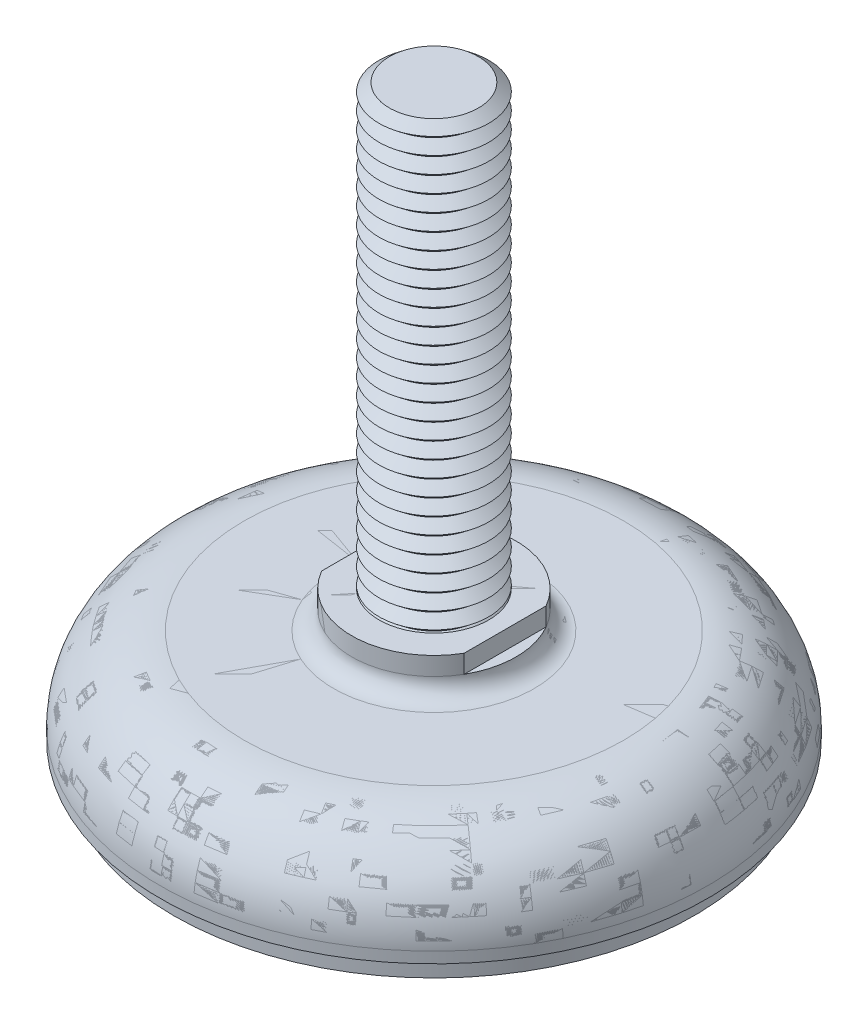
ISO-10303-21;
HEADER;
FILE_DESCRIPTION(('STEP AP214'),'2;1');
FILE_NAME('part.step','',(''),(''),'','','');
FILE_SCHEMA(('AUTOMOTIVE_DESIGN { 1 0 10303 214 1 1 1 1 }'));
ENDSEC;
DATA;
#1=APPLICATION_CONTEXT('core data for automotive mechanical design processes');
#2=APPLICATION_PROTOCOL_DEFINITION('international standard','automotive_design',2000,#1);
#3=PRODUCT_CONTEXT('',#1,'mechanical');
#4=PRODUCT('Part','Part','',(#3));
#5=PRODUCT_RELATED_PRODUCT_CATEGORY('part','',(#4));
#6=PRODUCT_DEFINITION_FORMATION('','',#4);
#7=PRODUCT_DEFINITION_CONTEXT('part definition',#1,'design');
#8=PRODUCT_DEFINITION('design','',#6,#7);
#9=PRODUCT_DEFINITION_SHAPE('','',#8);
#10=(LENGTH_UNIT() NAMED_UNIT(*) SI_UNIT(.MILLI.,.METRE.));
#11=(NAMED_UNIT(*) PLANE_ANGLE_UNIT() SI_UNIT($,.RADIAN.));
#12=(NAMED_UNIT(*) SI_UNIT($,.STERADIAN.) SOLID_ANGLE_UNIT());
#13=UNCERTAINTY_MEASURE_WITH_UNIT(LENGTH_MEASURE(1.E-05),#10,'distance_accuracy_value','');
#14=(GEOMETRIC_REPRESENTATION_CONTEXT(3) GLOBAL_UNCERTAINTY_ASSIGNED_CONTEXT((#13)) GLOBAL_UNIT_ASSIGNED_CONTEXT((#10,
#11,#12)) REPRESENTATION_CONTEXT('',''));
#15=CARTESIAN_POINT('',(0.,0.,0.));
#16=DIRECTION('',(0.,0.,1.));
#17=DIRECTION('',(1.,0.,0.));
#18=AXIS2_PLACEMENT_3D('',#15,#16,#17);
#19=CARTESIAN_POINT('',(0.,49.5,0.));
#20=DIRECTION('',(0.,-1.,0.));
#21=DIRECTION('',(0.998136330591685,0.,-0.0610234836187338));
#22=AXIS2_PLACEMENT_3D('',#19,#20,#21);
#23=CONICAL_SURFACE('',#22,4.06325030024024,0.895664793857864);
#24=CARTESIAN_POINT('',(0.,48.75,0.));
#25=DIRECTION('',(0.,-1.,0.));
#26=DIRECTION('',(0.998136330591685,0.,-0.0610234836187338));
#27=AXIS2_PLACEMENT_3D('',#24,#25,#26);
#28=CIRCLE('',#27,5.);
#29=CARTESIAN_POINT('',(4.99068165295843,48.75,-0.305117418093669));
#30=VERTEX_POINT('',#29);
#31=EDGE_CURVE('P0_E37',#30,#30,#28,.T.);
#32=ORIENTED_EDGE('',*,*,#31,.F.);
#33=EDGE_LOOP('',(#32));
#34=FACE_BOUND('',#33,.T.);
#35=CARTESIAN_POINT('',(0.,49.5,0.));
#36=DIRECTION('',(0.,-1.,0.));
#37=DIRECTION('',(0.998136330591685,0.,-0.0610234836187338));
#38=AXIS2_PLACEMENT_3D('',#35,#36,#37);
#39=CIRCLE('',#38,4.06325030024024);
#40=CARTESIAN_POINT('',(4.05567774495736,49.5,-0.247953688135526));
#41=VERTEX_POINT('',#40);
#42=EDGE_CURVE('P0_E25',#41,#41,#39,.T.);
#43=ORIENTED_EDGE('',*,*,#42,.T.);
#44=EDGE_LOOP('',(#43));
#45=FACE_BOUND('',#44,.T.);
#46=ADVANCED_FACE('P0_F14',(#34,#45),#23,.T.);
#47=CARTESIAN_POINT('',(0.,50.25,0.));
#48=DIRECTION('',(0.,1.,0.));
#49=DIRECTION('',(-0.998136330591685,0.,0.0610234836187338));
#50=AXIS2_PLACEMENT_3D('',#47,#48,#49);
#51=CONICAL_SURFACE('',#50,5.,0.895664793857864);
#52=ORIENTED_EDGE('',*,*,#42,.F.);
#53=EDGE_LOOP('',(#52));
#54=FACE_BOUND('',#53,.T.);
#55=CARTESIAN_POINT('',(0.,50.25,0.));
#56=DIRECTION('',(0.,-1.,0.));
#57=DIRECTION('',(0.998136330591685,0.,-0.0610234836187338));
#58=AXIS2_PLACEMENT_3D('',#55,#56,#57);
#59=CIRCLE('',#58,5.);
#60=CARTESIAN_POINT('',(4.99068165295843,50.25,-0.305117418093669));
#61=VERTEX_POINT('',#60);
#62=EDGE_CURVE('P0_E29',#61,#61,#59,.T.);
#63=ORIENTED_EDGE('',*,*,#62,.T.);
#64=EDGE_LOOP('',(#63));
#65=FACE_BOUND('',#64,.T.);
#66=ADVANCED_FACE('P0_F565',(#54,#65),#51,.T.);
#67=CARTESIAN_POINT('',(0.,51.,0.));
#68=DIRECTION('',(0.,1.,0.));
#69=DIRECTION('',(-0.998136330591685,0.,0.0610234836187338));
#70=AXIS2_PLACEMENT_3D('',#67,#68,#69);
#71=PLANE('',#70);
#72=CARTESIAN_POINT('',(0.,51.,0.));
#73=DIRECTION('',(0.,-1.,0.));
#74=DIRECTION('',(0.998136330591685,0.,-0.0610234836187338));
#75=AXIS2_PLACEMENT_3D('',#72,#73,#74);
#76=CIRCLE('',#75,4.06325030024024);
#77=CARTESIAN_POINT('',(4.05567774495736,51.,-0.247953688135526));
#78=VERTEX_POINT('',#77);
#79=EDGE_CURVE('P0_E21',#78,#78,#76,.T.);
#80=ORIENTED_EDGE('',*,*,#79,.F.);
#81=EDGE_LOOP('',(#80));
#82=FACE_BOUND('',#81,.T.);
#83=ADVANCED_FACE('P0_F571',(#82),#71,.T.);
#84=CARTESIAN_POINT('',(0.,51.,0.));
#85=DIRECTION('',(0.,-1.,0.));
#86=DIRECTION('',(0.998136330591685,0.,-0.0610234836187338));
#87=AXIS2_PLACEMENT_3D('',#84,#85,#86);
#88=CONICAL_SURFACE('',#87,4.06325030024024,0.895664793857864);
#89=ORIENTED_EDGE('',*,*,#62,.F.);
#90=EDGE_LOOP('',(#89));
#91=FACE_BOUND('',#90,.T.);
#92=ORIENTED_EDGE('',*,*,#79,.T.);
#93=EDGE_LOOP('',(#92));
#94=FACE_BOUND('',#93,.T.);
#95=ADVANCED_FACE('P0_F554',(#91,#94),#88,.T.);
#96=CARTESIAN_POINT('',(0.,48.,0.));
#97=DIRECTION('',(0.,-1.,0.));
#98=DIRECTION('',(0.998136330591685,0.,-0.0610234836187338));
#99=AXIS2_PLACEMENT_3D('',#96,#97,#98);
#100=CONICAL_SURFACE('',#99,4.06325030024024,0.895664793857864);
#101=CARTESIAN_POINT('',(0.,47.25,0.));
#102=DIRECTION('',(0.,-1.,0.));
#103=DIRECTION('',(0.998136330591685,0.,-0.0610234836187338));
#104=AXIS2_PLACEMENT_3D('',#101,#102,#103);
#105=CIRCLE('',#104,5.);
#106=CARTESIAN_POINT('',(4.99068165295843,47.25,-0.305117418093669));
#107=VERTEX_POINT('',#106);
#108=EDGE_CURVE('P0_E43',#107,#107,#105,.T.);
#109=ORIENTED_EDGE('',*,*,#108,.F.);
#110=EDGE_LOOP('',(#109));
#111=FACE_BOUND('',#110,.T.);
#112=CARTESIAN_POINT('',(0.,48.,0.));
#113=DIRECTION('',(0.,-1.,0.));
#114=DIRECTION('',(0.998136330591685,0.,-0.0610234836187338));
#115=AXIS2_PLACEMENT_3D('',#112,#113,#114);
#116=CIRCLE('',#115,4.06325030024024);
#117=CARTESIAN_POINT('',(4.05567774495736,48.,-0.247953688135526));
#118=VERTEX_POINT('',#117);
#119=EDGE_CURVE('P0_E34',#118,#118,#116,.T.);
#120=ORIENTED_EDGE('',*,*,#119,.T.);
#121=EDGE_LOOP('',(#120));
#122=FACE_BOUND('',#121,.T.);
#123=ADVANCED_FACE('P0_F551',(#111,#122),#100,.T.);
#124=CARTESIAN_POINT('',(0.,48.75,0.));
#125=DIRECTION('',(0.,1.,0.));
#126=DIRECTION('',(-0.998136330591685,0.,0.0610234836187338));
#127=AXIS2_PLACEMENT_3D('',#124,#125,#126);
#128=CONICAL_SURFACE('',#127,5.,0.895664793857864);
#129=ORIENTED_EDGE('',*,*,#119,.F.);
#130=EDGE_LOOP('',(#129));
#131=FACE_BOUND('',#130,.T.);
#132=ORIENTED_EDGE('',*,*,#31,.T.);
#133=EDGE_LOOP('',(#132));
#134=FACE_BOUND('',#133,.T.);
#135=ADVANCED_FACE('P0_F542',(#131,#134),#128,.T.);
#136=CARTESIAN_POINT('',(0.,46.5,0.));
#137=DIRECTION('',(0.,-1.,0.));
#138=DIRECTION('',(0.998136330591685,0.,-0.0610234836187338));
#139=AXIS2_PLACEMENT_3D('',#136,#137,#138);
#140=CONICAL_SURFACE('',#139,4.06325030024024,0.895664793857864);
#141=CARTESIAN_POINT('',(0.,45.75,0.));
#142=DIRECTION('',(0.,-1.,0.));
#143=DIRECTION('',(0.998136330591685,0.,-0.0610234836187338));
#144=AXIS2_PLACEMENT_3D('',#141,#142,#143);
#145=CIRCLE('',#144,5.);
#146=CARTESIAN_POINT('',(4.99068165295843,45.75,-0.305117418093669));
#147=VERTEX_POINT('',#146);
#148=EDGE_CURVE('P0_E49',#147,#147,#145,.T.);
#149=ORIENTED_EDGE('',*,*,#148,.F.);
#150=EDGE_LOOP('',(#149));
#151=FACE_BOUND('',#150,.T.);
#152=CARTESIAN_POINT('',(0.,46.5,0.));
#153=DIRECTION('',(0.,-1.,0.));
#154=DIRECTION('',(0.998136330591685,0.,-0.0610234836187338));
#155=AXIS2_PLACEMENT_3D('',#152,#153,#154);
#156=CIRCLE('',#155,4.06325030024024);
#157=CARTESIAN_POINT('',(4.05567774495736,46.5,-0.247953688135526));
#158=VERTEX_POINT('',#157);
#159=EDGE_CURVE('P0_E40',#158,#158,#156,.T.);
#160=ORIENTED_EDGE('',*,*,#159,.T.);
#161=EDGE_LOOP('',(#160));
#162=FACE_BOUND('',#161,.T.);
#163=ADVANCED_FACE('P0_F539',(#151,#162),#140,.T.);
#164=CARTESIAN_POINT('',(0.,47.25,0.));
#165=DIRECTION('',(0.,1.,0.));
#166=DIRECTION('',(-0.998136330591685,0.,0.0610234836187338));
#167=AXIS2_PLACEMENT_3D('',#164,#165,#166);
#168=CONICAL_SURFACE('',#167,5.,0.895664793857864);
#169=ORIENTED_EDGE('',*,*,#159,.F.);
#170=EDGE_LOOP('',(#169));
#171=FACE_BOUND('',#170,.T.);
#172=ORIENTED_EDGE('',*,*,#108,.T.);
#173=EDGE_LOOP('',(#172));
#174=FACE_BOUND('',#173,.T.);
#175=ADVANCED_FACE('P0_F530',(#171,#174),#168,.T.);
#176=CARTESIAN_POINT('',(0.,45.,0.));
#177=DIRECTION('',(0.,-1.,0.));
#178=DIRECTION('',(0.998136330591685,0.,-0.0610234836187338));
#179=AXIS2_PLACEMENT_3D('',#176,#177,#178);
#180=CONICAL_SURFACE('',#179,4.06325030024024,0.895664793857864);
#181=CARTESIAN_POINT('',(0.,44.25,0.));
#182=DIRECTION('',(0.,-1.,0.));
#183=DIRECTION('',(0.998136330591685,0.,-0.0610234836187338));
#184=AXIS2_PLACEMENT_3D('',#181,#182,#183);
#185=CIRCLE('',#184,5.);
#186=CARTESIAN_POINT('',(4.99068165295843,44.25,-0.305117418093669));
#187=VERTEX_POINT('',#186);
#188=EDGE_CURVE('P0_E55',#187,#187,#185,.T.);
#189=ORIENTED_EDGE('',*,*,#188,.F.);
#190=EDGE_LOOP('',(#189));
#191=FACE_BOUND('',#190,.T.);
#192=CARTESIAN_POINT('',(0.,45.,0.));
#193=DIRECTION('',(0.,-1.,0.));
#194=DIRECTION('',(0.998136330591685,0.,-0.0610234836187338));
#195=AXIS2_PLACEMENT_3D('',#192,#193,#194);
#196=CIRCLE('',#195,4.06325030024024);
#197=CARTESIAN_POINT('',(4.05567774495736,45.,-0.247953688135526));
#198=VERTEX_POINT('',#197);
#199=EDGE_CURVE('P0_E46',#198,#198,#196,.T.);
#200=ORIENTED_EDGE('',*,*,#199,.T.);
#201=EDGE_LOOP('',(#200));
#202=FACE_BOUND('',#201,.T.);
#203=ADVANCED_FACE('P0_F527',(#191,#202),#180,.T.);
#204=CARTESIAN_POINT('',(0.,45.75,0.));
#205=DIRECTION('',(0.,1.,0.));
#206=DIRECTION('',(-0.998136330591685,0.,0.0610234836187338));
#207=AXIS2_PLACEMENT_3D('',#204,#205,#206);
#208=CONICAL_SURFACE('',#207,5.,0.895664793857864);
#209=ORIENTED_EDGE('',*,*,#199,.F.);
#210=EDGE_LOOP('',(#209));
#211=FACE_BOUND('',#210,.T.);
#212=ORIENTED_EDGE('',*,*,#148,.T.);
#213=EDGE_LOOP('',(#212));
#214=FACE_BOUND('',#213,.T.);
#215=ADVANCED_FACE('P0_F518',(#211,#214),#208,.T.);
#216=CARTESIAN_POINT('',(0.,43.5,0.));
#217=DIRECTION('',(0.,-1.,0.));
#218=DIRECTION('',(0.998136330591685,0.,-0.0610234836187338));
#219=AXIS2_PLACEMENT_3D('',#216,#217,#218);
#220=CONICAL_SURFACE('',#219,4.06325030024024,0.895664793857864);
#221=CARTESIAN_POINT('',(0.,42.75,0.));
#222=DIRECTION('',(0.,-1.,0.));
#223=DIRECTION('',(0.998136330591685,0.,-0.0610234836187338));
#224=AXIS2_PLACEMENT_3D('',#221,#222,#223);
#225=CIRCLE('',#224,5.);
#226=CARTESIAN_POINT('',(4.99068165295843,42.75,-0.305117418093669));
#227=VERTEX_POINT('',#226);
#228=EDGE_CURVE('P0_E61',#227,#227,#225,.T.);
#229=ORIENTED_EDGE('',*,*,#228,.F.);
#230=EDGE_LOOP('',(#229));
#231=FACE_BOUND('',#230,.T.);
#232=CARTESIAN_POINT('',(0.,43.5,0.));
#233=DIRECTION('',(0.,-1.,0.));
#234=DIRECTION('',(0.998136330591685,0.,-0.0610234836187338));
#235=AXIS2_PLACEMENT_3D('',#232,#233,#234);
#236=CIRCLE('',#235,4.06325030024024);
#237=CARTESIAN_POINT('',(4.05567774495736,43.5,-0.247953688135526));
#238=VERTEX_POINT('',#237);
#239=EDGE_CURVE('P0_E52',#238,#238,#236,.T.);
#240=ORIENTED_EDGE('',*,*,#239,.T.);
#241=EDGE_LOOP('',(#240));
#242=FACE_BOUND('',#241,.T.);
#243=ADVANCED_FACE('P0_F515',(#231,#242),#220,.T.);
#244=CARTESIAN_POINT('',(0.,44.25,0.));
#245=DIRECTION('',(0.,1.,0.));
#246=DIRECTION('',(-0.998136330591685,0.,0.0610234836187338));
#247=AXIS2_PLACEMENT_3D('',#244,#245,#246);
#248=CONICAL_SURFACE('',#247,5.,0.895664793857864);
#249=ORIENTED_EDGE('',*,*,#239,.F.);
#250=EDGE_LOOP('',(#249));
#251=FACE_BOUND('',#250,.T.);
#252=ORIENTED_EDGE('',*,*,#188,.T.);
#253=EDGE_LOOP('',(#252));
#254=FACE_BOUND('',#253,.T.);
#255=ADVANCED_FACE('P0_F506',(#251,#254),#248,.T.);
#256=CARTESIAN_POINT('',(0.,42.,0.));
#257=DIRECTION('',(0.,-1.,0.));
#258=DIRECTION('',(0.998136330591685,0.,-0.0610234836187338));
#259=AXIS2_PLACEMENT_3D('',#256,#257,#258);
#260=CONICAL_SURFACE('',#259,4.06325030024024,0.895664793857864);
#261=CARTESIAN_POINT('',(0.,41.25,0.));
#262=DIRECTION('',(0.,-1.,0.));
#263=DIRECTION('',(0.998136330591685,0.,-0.0610234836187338));
#264=AXIS2_PLACEMENT_3D('',#261,#262,#263);
#265=CIRCLE('',#264,5.);
#266=CARTESIAN_POINT('',(4.99068165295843,41.25,-0.305117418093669));
#267=VERTEX_POINT('',#266);
#268=EDGE_CURVE('P0_E67',#267,#267,#265,.T.);
#269=ORIENTED_EDGE('',*,*,#268,.F.);
#270=EDGE_LOOP('',(#269));
#271=FACE_BOUND('',#270,.T.);
#272=CARTESIAN_POINT('',(0.,42.,0.));
#273=DIRECTION('',(0.,-1.,0.));
#274=DIRECTION('',(0.998136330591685,0.,-0.0610234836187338));
#275=AXIS2_PLACEMENT_3D('',#272,#273,#274);
#276=CIRCLE('',#275,4.06325030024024);
#277=CARTESIAN_POINT('',(4.05567774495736,42.,-0.247953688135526));
#278=VERTEX_POINT('',#277);
#279=EDGE_CURVE('P0_E58',#278,#278,#276,.T.);
#280=ORIENTED_EDGE('',*,*,#279,.T.);
#281=EDGE_LOOP('',(#280));
#282=FACE_BOUND('',#281,.T.);
#283=ADVANCED_FACE('P0_F503',(#271,#282),#260,.T.);
#284=CARTESIAN_POINT('',(0.,42.75,0.));
#285=DIRECTION('',(0.,1.,0.));
#286=DIRECTION('',(-0.998136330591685,0.,0.0610234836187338));
#287=AXIS2_PLACEMENT_3D('',#284,#285,#286);
#288=CONICAL_SURFACE('',#287,5.,0.895664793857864);
#289=ORIENTED_EDGE('',*,*,#279,.F.);
#290=EDGE_LOOP('',(#289));
#291=FACE_BOUND('',#290,.T.);
#292=ORIENTED_EDGE('',*,*,#228,.T.);
#293=EDGE_LOOP('',(#292));
#294=FACE_BOUND('',#293,.T.);
#295=ADVANCED_FACE('P0_F494',(#291,#294),#288,.T.);
#296=CARTESIAN_POINT('',(0.,40.5,0.));
#297=DIRECTION('',(0.,-1.,0.));
#298=DIRECTION('',(0.998136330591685,0.,-0.0610234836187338));
#299=AXIS2_PLACEMENT_3D('',#296,#297,#298);
#300=CONICAL_SURFACE('',#299,4.06325030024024,0.895664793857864);
#301=CARTESIAN_POINT('',(0.,39.75,0.));
#302=DIRECTION('',(0.,-1.,0.));
#303=DIRECTION('',(0.998136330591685,0.,-0.0610234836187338));
#304=AXIS2_PLACEMENT_3D('',#301,#302,#303);
#305=CIRCLE('',#304,5.);
#306=CARTESIAN_POINT('',(4.99068165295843,39.75,-0.305117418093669));
#307=VERTEX_POINT('',#306);
#308=EDGE_CURVE('P0_E73',#307,#307,#305,.T.);
#309=ORIENTED_EDGE('',*,*,#308,.F.);
#310=EDGE_LOOP('',(#309));
#311=FACE_BOUND('',#310,.T.);
#312=CARTESIAN_POINT('',(0.,40.5,0.));
#313=DIRECTION('',(0.,-1.,0.));
#314=DIRECTION('',(0.998136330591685,0.,-0.0610234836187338));
#315=AXIS2_PLACEMENT_3D('',#312,#313,#314);
#316=CIRCLE('',#315,4.06325030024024);
#317=CARTESIAN_POINT('',(4.05567774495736,40.5,-0.247953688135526));
#318=VERTEX_POINT('',#317);
#319=EDGE_CURVE('P0_E64',#318,#318,#316,.T.);
#320=ORIENTED_EDGE('',*,*,#319,.T.);
#321=EDGE_LOOP('',(#320));
#322=FACE_BOUND('',#321,.T.);
#323=ADVANCED_FACE('P0_F491',(#311,#322),#300,.T.);
#324=CARTESIAN_POINT('',(0.,41.25,0.));
#325=DIRECTION('',(0.,1.,0.));
#326=DIRECTION('',(-0.998136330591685,0.,0.0610234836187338));
#327=AXIS2_PLACEMENT_3D('',#324,#325,#326);
#328=CONICAL_SURFACE('',#327,5.,0.895664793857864);
#329=ORIENTED_EDGE('',*,*,#319,.F.);
#330=EDGE_LOOP('',(#329));
#331=FACE_BOUND('',#330,.T.);
#332=ORIENTED_EDGE('',*,*,#268,.T.);
#333=EDGE_LOOP('',(#332));
#334=FACE_BOUND('',#333,.T.);
#335=ADVANCED_FACE('P0_F482',(#331,#334),#328,.T.);
#336=CARTESIAN_POINT('',(0.,39.,0.));
#337=DIRECTION('',(0.,-1.,0.));
#338=DIRECTION('',(0.998136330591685,0.,-0.0610234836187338));
#339=AXIS2_PLACEMENT_3D('',#336,#337,#338);
#340=CONICAL_SURFACE('',#339,4.06325030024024,0.895664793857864);
#341=CARTESIAN_POINT('',(0.,38.25,0.));
#342=DIRECTION('',(0.,-1.,0.));
#343=DIRECTION('',(0.998136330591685,0.,-0.0610234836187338));
#344=AXIS2_PLACEMENT_3D('',#341,#342,#343);
#345=CIRCLE('',#344,5.);
#346=CARTESIAN_POINT('',(4.99068165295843,38.25,-0.305117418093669));
#347=VERTEX_POINT('',#346);
#348=EDGE_CURVE('P0_E79',#347,#347,#345,.T.);
#349=ORIENTED_EDGE('',*,*,#348,.F.);
#350=EDGE_LOOP('',(#349));
#351=FACE_BOUND('',#350,.T.);
#352=CARTESIAN_POINT('',(0.,39.,0.));
#353=DIRECTION('',(0.,-1.,0.));
#354=DIRECTION('',(0.998136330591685,0.,-0.0610234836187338));
#355=AXIS2_PLACEMENT_3D('',#352,#353,#354);
#356=CIRCLE('',#355,4.06325030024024);
#357=CARTESIAN_POINT('',(4.05567774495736,39.,-0.247953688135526));
#358=VERTEX_POINT('',#357);
#359=EDGE_CURVE('P0_E70',#358,#358,#356,.T.);
#360=ORIENTED_EDGE('',*,*,#359,.T.);
#361=EDGE_LOOP('',(#360));
#362=FACE_BOUND('',#361,.T.);
#363=ADVANCED_FACE('P0_F479',(#351,#362),#340,.T.);
#364=CARTESIAN_POINT('',(0.,39.75,0.));
#365=DIRECTION('',(0.,1.,0.));
#366=DIRECTION('',(-0.998136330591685,0.,0.0610234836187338));
#367=AXIS2_PLACEMENT_3D('',#364,#365,#366);
#368=CONICAL_SURFACE('',#367,5.,0.895664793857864);
#369=ORIENTED_EDGE('',*,*,#359,.F.);
#370=EDGE_LOOP('',(#369));
#371=FACE_BOUND('',#370,.T.);
#372=ORIENTED_EDGE('',*,*,#308,.T.);
#373=EDGE_LOOP('',(#372));
#374=FACE_BOUND('',#373,.T.);
#375=ADVANCED_FACE('P0_F470',(#371,#374),#368,.T.);
#376=CARTESIAN_POINT('',(0.,37.5,0.));
#377=DIRECTION('',(0.,-1.,0.));
#378=DIRECTION('',(0.998136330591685,0.,-0.0610234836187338));
#379=AXIS2_PLACEMENT_3D('',#376,#377,#378);
#380=CONICAL_SURFACE('',#379,4.06325030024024,0.895664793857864);
#381=CARTESIAN_POINT('',(0.,36.75,0.));
#382=DIRECTION('',(0.,-1.,0.));
#383=DIRECTION('',(0.998136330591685,0.,-0.0610234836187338));
#384=AXIS2_PLACEMENT_3D('',#381,#382,#383);
#385=CIRCLE('',#384,5.);
#386=CARTESIAN_POINT('',(4.99068165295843,36.75,-0.305117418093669));
#387=VERTEX_POINT('',#386);
#388=EDGE_CURVE('P0_E85',#387,#387,#385,.T.);
#389=ORIENTED_EDGE('',*,*,#388,.F.);
#390=EDGE_LOOP('',(#389));
#391=FACE_BOUND('',#390,.T.);
#392=CARTESIAN_POINT('',(0.,37.5,0.));
#393=DIRECTION('',(0.,-1.,0.));
#394=DIRECTION('',(0.998136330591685,0.,-0.0610234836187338));
#395=AXIS2_PLACEMENT_3D('',#392,#393,#394);
#396=CIRCLE('',#395,4.06325030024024);
#397=CARTESIAN_POINT('',(4.05567774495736,37.5,-0.247953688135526));
#398=VERTEX_POINT('',#397);
#399=EDGE_CURVE('P0_E76',#398,#398,#396,.T.);
#400=ORIENTED_EDGE('',*,*,#399,.T.);
#401=EDGE_LOOP('',(#400));
#402=FACE_BOUND('',#401,.T.);
#403=ADVANCED_FACE('P0_F467',(#391,#402),#380,.T.);
#404=CARTESIAN_POINT('',(0.,38.25,0.));
#405=DIRECTION('',(0.,1.,0.));
#406=DIRECTION('',(-0.998136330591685,0.,0.0610234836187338));
#407=AXIS2_PLACEMENT_3D('',#404,#405,#406);
#408=CONICAL_SURFACE('',#407,5.,0.895664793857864);
#409=ORIENTED_EDGE('',*,*,#399,.F.);
#410=EDGE_LOOP('',(#409));
#411=FACE_BOUND('',#410,.T.);
#412=ORIENTED_EDGE('',*,*,#348,.T.);
#413=EDGE_LOOP('',(#412));
#414=FACE_BOUND('',#413,.T.);
#415=ADVANCED_FACE('P0_F458',(#411,#414),#408,.T.);
#416=CARTESIAN_POINT('',(0.,36.,0.));
#417=DIRECTION('',(0.,-1.,0.));
#418=DIRECTION('',(0.998136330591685,0.,-0.0610234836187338));
#419=AXIS2_PLACEMENT_3D('',#416,#417,#418);
#420=CONICAL_SURFACE('',#419,4.06325030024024,0.895664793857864);
#421=CARTESIAN_POINT('',(0.,35.25,0.));
#422=DIRECTION('',(0.,-1.,0.));
#423=DIRECTION('',(0.998136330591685,0.,-0.0610234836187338));
#424=AXIS2_PLACEMENT_3D('',#421,#422,#423);
#425=CIRCLE('',#424,5.);
#426=CARTESIAN_POINT('',(4.99068165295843,35.25,-0.305117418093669));
#427=VERTEX_POINT('',#426);
#428=EDGE_CURVE('P0_E91',#427,#427,#425,.T.);
#429=ORIENTED_EDGE('',*,*,#428,.F.);
#430=EDGE_LOOP('',(#429));
#431=FACE_BOUND('',#430,.T.);
#432=CARTESIAN_POINT('',(0.,36.,0.));
#433=DIRECTION('',(0.,-1.,0.));
#434=DIRECTION('',(0.998136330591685,0.,-0.0610234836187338));
#435=AXIS2_PLACEMENT_3D('',#432,#433,#434);
#436=CIRCLE('',#435,4.06325030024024);
#437=CARTESIAN_POINT('',(4.05567774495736,36.,-0.247953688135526));
#438=VERTEX_POINT('',#437);
#439=EDGE_CURVE('P0_E82',#438,#438,#436,.T.);
#440=ORIENTED_EDGE('',*,*,#439,.T.);
#441=EDGE_LOOP('',(#440));
#442=FACE_BOUND('',#441,.T.);
#443=ADVANCED_FACE('P0_F455',(#431,#442),#420,.T.);
#444=CARTESIAN_POINT('',(0.,36.75,0.));
#445=DIRECTION('',(0.,1.,0.));
#446=DIRECTION('',(-0.998136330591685,0.,0.0610234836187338));
#447=AXIS2_PLACEMENT_3D('',#444,#445,#446);
#448=CONICAL_SURFACE('',#447,5.,0.895664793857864);
#449=ORIENTED_EDGE('',*,*,#439,.F.);
#450=EDGE_LOOP('',(#449));
#451=FACE_BOUND('',#450,.T.);
#452=ORIENTED_EDGE('',*,*,#388,.T.);
#453=EDGE_LOOP('',(#452));
#454=FACE_BOUND('',#453,.T.);
#455=ADVANCED_FACE('P0_F446',(#451,#454),#448,.T.);
#456=CARTESIAN_POINT('',(0.,34.5,0.));
#457=DIRECTION('',(0.,-1.,0.));
#458=DIRECTION('',(0.998136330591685,0.,-0.0610234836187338));
#459=AXIS2_PLACEMENT_3D('',#456,#457,#458);
#460=CONICAL_SURFACE('',#459,4.06325030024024,0.895664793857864);
#461=CARTESIAN_POINT('',(0.,33.75,0.));
#462=DIRECTION('',(0.,-1.,0.));
#463=DIRECTION('',(0.998136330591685,0.,-0.0610234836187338));
#464=AXIS2_PLACEMENT_3D('',#461,#462,#463);
#465=CIRCLE('',#464,5.);
#466=CARTESIAN_POINT('',(4.99068165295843,33.75,-0.305117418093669));
#467=VERTEX_POINT('',#466);
#468=EDGE_CURVE('P0_E97',#467,#467,#465,.T.);
#469=ORIENTED_EDGE('',*,*,#468,.F.);
#470=EDGE_LOOP('',(#469));
#471=FACE_BOUND('',#470,.T.);
#472=CARTESIAN_POINT('',(0.,34.5,0.));
#473=DIRECTION('',(0.,-1.,0.));
#474=DIRECTION('',(0.998136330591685,0.,-0.0610234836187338));
#475=AXIS2_PLACEMENT_3D('',#472,#473,#474);
#476=CIRCLE('',#475,4.06325030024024);
#477=CARTESIAN_POINT('',(4.05567774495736,34.5,-0.247953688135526));
#478=VERTEX_POINT('',#477);
#479=EDGE_CURVE('P0_E88',#478,#478,#476,.T.);
#480=ORIENTED_EDGE('',*,*,#479,.T.);
#481=EDGE_LOOP('',(#480));
#482=FACE_BOUND('',#481,.T.);
#483=ADVANCED_FACE('P0_F443',(#471,#482),#460,.T.);
#484=CARTESIAN_POINT('',(0.,35.25,0.));
#485=DIRECTION('',(0.,1.,0.));
#486=DIRECTION('',(-0.998136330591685,0.,0.0610234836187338));
#487=AXIS2_PLACEMENT_3D('',#484,#485,#486);
#488=CONICAL_SURFACE('',#487,5.,0.895664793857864);
#489=ORIENTED_EDGE('',*,*,#479,.F.);
#490=EDGE_LOOP('',(#489));
#491=FACE_BOUND('',#490,.T.);
#492=ORIENTED_EDGE('',*,*,#428,.T.);
#493=EDGE_LOOP('',(#492));
#494=FACE_BOUND('',#493,.T.);
#495=ADVANCED_FACE('P0_F434',(#491,#494),#488,.T.);
#496=CARTESIAN_POINT('',(0.,33.,0.));
#497=DIRECTION('',(0.,-1.,0.));
#498=DIRECTION('',(0.998136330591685,0.,-0.0610234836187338));
#499=AXIS2_PLACEMENT_3D('',#496,#497,#498);
#500=CONICAL_SURFACE('',#499,4.06325030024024,0.895664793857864);
#501=CARTESIAN_POINT('',(0.,32.25,0.));
#502=DIRECTION('',(0.,-1.,0.));
#503=DIRECTION('',(0.998136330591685,0.,-0.0610234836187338));
#504=AXIS2_PLACEMENT_3D('',#501,#502,#503);
#505=CIRCLE('',#504,5.);
#506=CARTESIAN_POINT('',(4.99068165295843,32.25,-0.305117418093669));
#507=VERTEX_POINT('',#506);
#508=EDGE_CURVE('P0_E103',#507,#507,#505,.T.);
#509=ORIENTED_EDGE('',*,*,#508,.F.);
#510=EDGE_LOOP('',(#509));
#511=FACE_BOUND('',#510,.T.);
#512=CARTESIAN_POINT('',(0.,33.,0.));
#513=DIRECTION('',(0.,-1.,0.));
#514=DIRECTION('',(0.998136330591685,0.,-0.0610234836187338));
#515=AXIS2_PLACEMENT_3D('',#512,#513,#514);
#516=CIRCLE('',#515,4.06325030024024);
#517=CARTESIAN_POINT('',(4.05567774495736,33.,-0.247953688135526));
#518=VERTEX_POINT('',#517);
#519=EDGE_CURVE('P0_E94',#518,#518,#516,.T.);
#520=ORIENTED_EDGE('',*,*,#519,.T.);
#521=EDGE_LOOP('',(#520));
#522=FACE_BOUND('',#521,.T.);
#523=ADVANCED_FACE('P0_F431',(#511,#522),#500,.T.);
#524=CARTESIAN_POINT('',(0.,33.75,0.));
#525=DIRECTION('',(0.,1.,0.));
#526=DIRECTION('',(-0.998136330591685,0.,0.0610234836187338));
#527=AXIS2_PLACEMENT_3D('',#524,#525,#526);
#528=CONICAL_SURFACE('',#527,5.,0.895664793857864);
#529=ORIENTED_EDGE('',*,*,#519,.F.);
#530=EDGE_LOOP('',(#529));
#531=FACE_BOUND('',#530,.T.);
#532=ORIENTED_EDGE('',*,*,#468,.T.);
#533=EDGE_LOOP('',(#532));
#534=FACE_BOUND('',#533,.T.);
#535=ADVANCED_FACE('P0_F422',(#531,#534),#528,.T.);
#536=CARTESIAN_POINT('',(0.,31.5,0.));
#537=DIRECTION('',(0.,-1.,0.));
#538=DIRECTION('',(0.998136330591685,0.,-0.0610234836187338));
#539=AXIS2_PLACEMENT_3D('',#536,#537,#538);
#540=CONICAL_SURFACE('',#539,4.06325030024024,0.895664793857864);
#541=CARTESIAN_POINT('',(0.,30.75,0.));
#542=DIRECTION('',(0.,-1.,0.));
#543=DIRECTION('',(0.998136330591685,0.,-0.0610234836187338));
#544=AXIS2_PLACEMENT_3D('',#541,#542,#543);
#545=CIRCLE('',#544,5.);
#546=CARTESIAN_POINT('',(4.99068165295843,30.75,-0.305117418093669));
#547=VERTEX_POINT('',#546);
#548=EDGE_CURVE('P0_E109',#547,#547,#545,.T.);
#549=ORIENTED_EDGE('',*,*,#548,.F.);
#550=EDGE_LOOP('',(#549));
#551=FACE_BOUND('',#550,.T.);
#552=CARTESIAN_POINT('',(0.,31.5,0.));
#553=DIRECTION('',(0.,-1.,0.));
#554=DIRECTION('',(0.998136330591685,0.,-0.0610234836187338));
#555=AXIS2_PLACEMENT_3D('',#552,#553,#554);
#556=CIRCLE('',#555,4.06325030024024);
#557=CARTESIAN_POINT('',(4.05567774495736,31.5,-0.247953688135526));
#558=VERTEX_POINT('',#557);
#559=EDGE_CURVE('P0_E100',#558,#558,#556,.T.);
#560=ORIENTED_EDGE('',*,*,#559,.T.);
#561=EDGE_LOOP('',(#560));
#562=FACE_BOUND('',#561,.T.);
#563=ADVANCED_FACE('P0_F419',(#551,#562),#540,.T.);
#564=CARTESIAN_POINT('',(0.,32.25,0.));
#565=DIRECTION('',(0.,1.,0.));
#566=DIRECTION('',(-0.998136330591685,0.,0.0610234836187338));
#567=AXIS2_PLACEMENT_3D('',#564,#565,#566);
#568=CONICAL_SURFACE('',#567,5.,0.895664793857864);
#569=ORIENTED_EDGE('',*,*,#559,.F.);
#570=EDGE_LOOP('',(#569));
#571=FACE_BOUND('',#570,.T.);
#572=ORIENTED_EDGE('',*,*,#508,.T.);
#573=EDGE_LOOP('',(#572));
#574=FACE_BOUND('',#573,.T.);
#575=ADVANCED_FACE('P0_F410',(#571,#574),#568,.T.);
#576=CARTESIAN_POINT('',(0.,30.,0.));
#577=DIRECTION('',(0.,-1.,0.));
#578=DIRECTION('',(0.998136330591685,0.,-0.0610234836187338));
#579=AXIS2_PLACEMENT_3D('',#576,#577,#578);
#580=CONICAL_SURFACE('',#579,4.06325030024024,0.895664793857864);
#581=CARTESIAN_POINT('',(0.,29.25,0.));
#582=DIRECTION('',(0.,-1.,0.));
#583=DIRECTION('',(0.998136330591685,0.,-0.0610234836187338));
#584=AXIS2_PLACEMENT_3D('',#581,#582,#583);
#585=CIRCLE('',#584,5.);
#586=CARTESIAN_POINT('',(4.99068165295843,29.25,-0.305117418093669));
#587=VERTEX_POINT('',#586);
#588=EDGE_CURVE('P0_E115',#587,#587,#585,.T.);
#589=ORIENTED_EDGE('',*,*,#588,.F.);
#590=EDGE_LOOP('',(#589));
#591=FACE_BOUND('',#590,.T.);
#592=CARTESIAN_POINT('',(0.,30.,0.));
#593=DIRECTION('',(0.,-1.,0.));
#594=DIRECTION('',(0.998136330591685,0.,-0.0610234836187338));
#595=AXIS2_PLACEMENT_3D('',#592,#593,#594);
#596=CIRCLE('',#595,4.06325030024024);
#597=CARTESIAN_POINT('',(4.05567774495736,30.,-0.247953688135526));
#598=VERTEX_POINT('',#597);
#599=EDGE_CURVE('P0_E106',#598,#598,#596,.T.);
#600=ORIENTED_EDGE('',*,*,#599,.T.);
#601=EDGE_LOOP('',(#600));
#602=FACE_BOUND('',#601,.T.);
#603=ADVANCED_FACE('P0_F407',(#591,#602),#580,.T.);
#604=CARTESIAN_POINT('',(0.,30.75,0.));
#605=DIRECTION('',(0.,1.,0.));
#606=DIRECTION('',(-0.998136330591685,0.,0.0610234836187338));
#607=AXIS2_PLACEMENT_3D('',#604,#605,#606);
#608=CONICAL_SURFACE('',#607,5.,0.895664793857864);
#609=ORIENTED_EDGE('',*,*,#599,.F.);
#610=EDGE_LOOP('',(#609));
#611=FACE_BOUND('',#610,.T.);
#612=ORIENTED_EDGE('',*,*,#548,.T.);
#613=EDGE_LOOP('',(#612));
#614=FACE_BOUND('',#613,.T.);
#615=ADVANCED_FACE('P0_F398',(#611,#614),#608,.T.);
#616=CARTESIAN_POINT('',(0.,28.5,0.));
#617=DIRECTION('',(0.,-1.,0.));
#618=DIRECTION('',(0.998136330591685,0.,-0.0610234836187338));
#619=AXIS2_PLACEMENT_3D('',#616,#617,#618);
#620=CONICAL_SURFACE('',#619,4.06325030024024,0.895664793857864);
#621=CARTESIAN_POINT('',(0.,27.75,0.));
#622=DIRECTION('',(0.,-1.,0.));
#623=DIRECTION('',(0.998136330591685,0.,-0.0610234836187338));
#624=AXIS2_PLACEMENT_3D('',#621,#622,#623);
#625=CIRCLE('',#624,5.);
#626=CARTESIAN_POINT('',(4.99068165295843,27.75,-0.305117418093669));
#627=VERTEX_POINT('',#626);
#628=EDGE_CURVE('P0_E121',#627,#627,#625,.T.);
#629=ORIENTED_EDGE('',*,*,#628,.F.);
#630=EDGE_LOOP('',(#629));
#631=FACE_BOUND('',#630,.T.);
#632=CARTESIAN_POINT('',(0.,28.5,0.));
#633=DIRECTION('',(0.,-1.,0.));
#634=DIRECTION('',(0.998136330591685,0.,-0.0610234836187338));
#635=AXIS2_PLACEMENT_3D('',#632,#633,#634);
#636=CIRCLE('',#635,4.06325030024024);
#637=CARTESIAN_POINT('',(4.05567774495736,28.5,-0.247953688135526));
#638=VERTEX_POINT('',#637);
#639=EDGE_CURVE('P0_E112',#638,#638,#636,.T.);
#640=ORIENTED_EDGE('',*,*,#639,.T.);
#641=EDGE_LOOP('',(#640));
#642=FACE_BOUND('',#641,.T.);
#643=ADVANCED_FACE('P0_F395',(#631,#642),#620,.T.);
#644=CARTESIAN_POINT('',(0.,29.25,0.));
#645=DIRECTION('',(0.,1.,0.));
#646=DIRECTION('',(-0.998136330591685,0.,0.0610234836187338));
#647=AXIS2_PLACEMENT_3D('',#644,#645,#646);
#648=CONICAL_SURFACE('',#647,5.,0.895664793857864);
#649=ORIENTED_EDGE('',*,*,#639,.F.);
#650=EDGE_LOOP('',(#649));
#651=FACE_BOUND('',#650,.T.);
#652=ORIENTED_EDGE('',*,*,#588,.T.);
#653=EDGE_LOOP('',(#652));
#654=FACE_BOUND('',#653,.T.);
#655=ADVANCED_FACE('P0_F386',(#651,#654),#648,.T.);
#656=CARTESIAN_POINT('',(0.,27.,0.));
#657=DIRECTION('',(0.,-1.,0.));
#658=DIRECTION('',(0.998136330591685,0.,-0.0610234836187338));
#659=AXIS2_PLACEMENT_3D('',#656,#657,#658);
#660=CONICAL_SURFACE('',#659,4.06325030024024,0.895664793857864);
#661=CARTESIAN_POINT('',(0.,26.25,0.));
#662=DIRECTION('',(0.,-1.,0.));
#663=DIRECTION('',(0.998136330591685,0.,-0.0610234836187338));
#664=AXIS2_PLACEMENT_3D('',#661,#662,#663);
#665=CIRCLE('',#664,5.);
#666=CARTESIAN_POINT('',(4.99068165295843,26.25,-0.305117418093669));
#667=VERTEX_POINT('',#666);
#668=EDGE_CURVE('P0_E127',#667,#667,#665,.T.);
#669=ORIENTED_EDGE('',*,*,#668,.F.);
#670=EDGE_LOOP('',(#669));
#671=FACE_BOUND('',#670,.T.);
#672=CARTESIAN_POINT('',(0.,27.,0.));
#673=DIRECTION('',(0.,-1.,0.));
#674=DIRECTION('',(0.998136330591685,0.,-0.0610234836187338));
#675=AXIS2_PLACEMENT_3D('',#672,#673,#674);
#676=CIRCLE('',#675,4.06325030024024);
#677=CARTESIAN_POINT('',(4.05567774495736,27.,-0.247953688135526));
#678=VERTEX_POINT('',#677);
#679=EDGE_CURVE('P0_E118',#678,#678,#676,.T.);
#680=ORIENTED_EDGE('',*,*,#679,.T.);
#681=EDGE_LOOP('',(#680));
#682=FACE_BOUND('',#681,.T.);
#683=ADVANCED_FACE('P0_F383',(#671,#682),#660,.T.);
#684=CARTESIAN_POINT('',(0.,27.75,0.));
#685=DIRECTION('',(0.,1.,0.));
#686=DIRECTION('',(-0.998136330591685,0.,0.0610234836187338));
#687=AXIS2_PLACEMENT_3D('',#684,#685,#686);
#688=CONICAL_SURFACE('',#687,5.,0.895664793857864);
#689=ORIENTED_EDGE('',*,*,#679,.F.);
#690=EDGE_LOOP('',(#689));
#691=FACE_BOUND('',#690,.T.);
#692=ORIENTED_EDGE('',*,*,#628,.T.);
#693=EDGE_LOOP('',(#692));
#694=FACE_BOUND('',#693,.T.);
#695=ADVANCED_FACE('P0_F374',(#691,#694),#688,.T.);
#696=CARTESIAN_POINT('',(0.,25.5,0.));
#697=DIRECTION('',(0.,-1.,0.));
#698=DIRECTION('',(0.998136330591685,0.,-0.0610234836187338));
#699=AXIS2_PLACEMENT_3D('',#696,#697,#698);
#700=CONICAL_SURFACE('',#699,4.06325030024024,0.895664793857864);
#701=CARTESIAN_POINT('',(0.,24.75,0.));
#702=DIRECTION('',(0.,-1.,0.));
#703=DIRECTION('',(0.998136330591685,0.,-0.0610234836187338));
#704=AXIS2_PLACEMENT_3D('',#701,#702,#703);
#705=CIRCLE('',#704,5.);
#706=CARTESIAN_POINT('',(4.99068165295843,24.75,-0.305117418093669));
#707=VERTEX_POINT('',#706);
#708=EDGE_CURVE('P0_E133',#707,#707,#705,.T.);
#709=ORIENTED_EDGE('',*,*,#708,.F.);
#710=EDGE_LOOP('',(#709));
#711=FACE_BOUND('',#710,.T.);
#712=CARTESIAN_POINT('',(0.,25.5,0.));
#713=DIRECTION('',(0.,-1.,0.));
#714=DIRECTION('',(0.998136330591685,0.,-0.0610234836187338));
#715=AXIS2_PLACEMENT_3D('',#712,#713,#714);
#716=CIRCLE('',#715,4.06325030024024);
#717=CARTESIAN_POINT('',(4.05567774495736,25.5,-0.247953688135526));
#718=VERTEX_POINT('',#717);
#719=EDGE_CURVE('P0_E124',#718,#718,#716,.T.);
#720=ORIENTED_EDGE('',*,*,#719,.T.);
#721=EDGE_LOOP('',(#720));
#722=FACE_BOUND('',#721,.T.);
#723=ADVANCED_FACE('P0_F371',(#711,#722),#700,.T.);
#724=CARTESIAN_POINT('',(0.,26.25,0.));
#725=DIRECTION('',(0.,1.,0.));
#726=DIRECTION('',(-0.998136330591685,0.,0.0610234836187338));
#727=AXIS2_PLACEMENT_3D('',#724,#725,#726);
#728=CONICAL_SURFACE('',#727,5.,0.895664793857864);
#729=ORIENTED_EDGE('',*,*,#719,.F.);
#730=EDGE_LOOP('',(#729));
#731=FACE_BOUND('',#730,.T.);
#732=ORIENTED_EDGE('',*,*,#668,.T.);
#733=EDGE_LOOP('',(#732));
#734=FACE_BOUND('',#733,.T.);
#735=ADVANCED_FACE('P0_F362',(#731,#734),#728,.T.);
#736=CARTESIAN_POINT('',(0.,24.,0.));
#737=DIRECTION('',(0.,-1.,0.));
#738=DIRECTION('',(0.998136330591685,0.,-0.0610234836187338));
#739=AXIS2_PLACEMENT_3D('',#736,#737,#738);
#740=CONICAL_SURFACE('',#739,4.06325030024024,0.895664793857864);
#741=CARTESIAN_POINT('',(0.,23.25,0.));
#742=DIRECTION('',(0.,-1.,0.));
#743=DIRECTION('',(0.998136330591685,0.,-0.0610234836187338));
#744=AXIS2_PLACEMENT_3D('',#741,#742,#743);
#745=CIRCLE('',#744,5.);
#746=CARTESIAN_POINT('',(4.99068165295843,23.25,-0.305117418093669));
#747=VERTEX_POINT('',#746);
#748=EDGE_CURVE('P0_E139',#747,#747,#745,.T.);
#749=ORIENTED_EDGE('',*,*,#748,.F.);
#750=EDGE_LOOP('',(#749));
#751=FACE_BOUND('',#750,.T.);
#752=CARTESIAN_POINT('',(0.,24.,0.));
#753=DIRECTION('',(0.,-1.,0.));
#754=DIRECTION('',(0.998136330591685,0.,-0.0610234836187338));
#755=AXIS2_PLACEMENT_3D('',#752,#753,#754);
#756=CIRCLE('',#755,4.06325030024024);
#757=CARTESIAN_POINT('',(4.05567774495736,24.,-0.247953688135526));
#758=VERTEX_POINT('',#757);
#759=EDGE_CURVE('P0_E130',#758,#758,#756,.T.);
#760=ORIENTED_EDGE('',*,*,#759,.T.);
#761=EDGE_LOOP('',(#760));
#762=FACE_BOUND('',#761,.T.);
#763=ADVANCED_FACE('P0_F359',(#751,#762),#740,.T.);
#764=CARTESIAN_POINT('',(0.,24.75,0.));
#765=DIRECTION('',(0.,1.,0.));
#766=DIRECTION('',(-0.998136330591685,0.,0.0610234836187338));
#767=AXIS2_PLACEMENT_3D('',#764,#765,#766);
#768=CONICAL_SURFACE('',#767,5.,0.895664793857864);
#769=ORIENTED_EDGE('',*,*,#759,.F.);
#770=EDGE_LOOP('',(#769));
#771=FACE_BOUND('',#770,.T.);
#772=ORIENTED_EDGE('',*,*,#708,.T.);
#773=EDGE_LOOP('',(#772));
#774=FACE_BOUND('',#773,.T.);
#775=ADVANCED_FACE('P0_F350',(#771,#774),#768,.T.);
#776=CARTESIAN_POINT('',(0.,22.5,0.));
#777=DIRECTION('',(0.,-1.,0.));
#778=DIRECTION('',(0.998136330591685,0.,-0.0610234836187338));
#779=AXIS2_PLACEMENT_3D('',#776,#777,#778);
#780=CONICAL_SURFACE('',#779,4.06325030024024,0.895664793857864);
#781=CARTESIAN_POINT('',(0.,21.75,0.));
#782=DIRECTION('',(0.,-1.,0.));
#783=DIRECTION('',(0.998136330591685,0.,-0.0610234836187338));
#784=AXIS2_PLACEMENT_3D('',#781,#782,#783);
#785=CIRCLE('',#784,5.);
#786=CARTESIAN_POINT('',(4.99068165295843,21.75,-0.305117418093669));
#787=VERTEX_POINT('',#786);
#788=EDGE_CURVE('P0_E145',#787,#787,#785,.T.);
#789=ORIENTED_EDGE('',*,*,#788,.F.);
#790=EDGE_LOOP('',(#789));
#791=FACE_BOUND('',#790,.T.);
#792=CARTESIAN_POINT('',(0.,22.5,0.));
#793=DIRECTION('',(0.,-1.,0.));
#794=DIRECTION('',(0.998136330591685,0.,-0.0610234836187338));
#795=AXIS2_PLACEMENT_3D('',#792,#793,#794);
#796=CIRCLE('',#795,4.06325030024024);
#797=CARTESIAN_POINT('',(4.05567774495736,22.5,-0.247953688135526));
#798=VERTEX_POINT('',#797);
#799=EDGE_CURVE('P0_E136',#798,#798,#796,.T.);
#800=ORIENTED_EDGE('',*,*,#799,.T.);
#801=EDGE_LOOP('',(#800));
#802=FACE_BOUND('',#801,.T.);
#803=ADVANCED_FACE('P0_F347',(#791,#802),#780,.T.);
#804=CARTESIAN_POINT('',(0.,23.25,0.));
#805=DIRECTION('',(0.,1.,0.));
#806=DIRECTION('',(-0.998136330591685,0.,0.0610234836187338));
#807=AXIS2_PLACEMENT_3D('',#804,#805,#806);
#808=CONICAL_SURFACE('',#807,5.,0.895664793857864);
#809=ORIENTED_EDGE('',*,*,#799,.F.);
#810=EDGE_LOOP('',(#809));
#811=FACE_BOUND('',#810,.T.);
#812=ORIENTED_EDGE('',*,*,#748,.T.);
#813=EDGE_LOOP('',(#812));
#814=FACE_BOUND('',#813,.T.);
#815=ADVANCED_FACE('P0_F338',(#811,#814),#808,.T.);
#816=CARTESIAN_POINT('',(0.,21.,0.));
#817=DIRECTION('',(0.,-1.,0.));
#818=DIRECTION('',(0.998136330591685,0.,-0.0610234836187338));
#819=AXIS2_PLACEMENT_3D('',#816,#817,#818);
#820=CONICAL_SURFACE('',#819,4.06325030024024,0.895664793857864);
#821=CARTESIAN_POINT('',(0.,20.25,0.));
#822=DIRECTION('',(0.,-1.,0.));
#823=DIRECTION('',(0.998136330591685,0.,-0.0610234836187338));
#824=AXIS2_PLACEMENT_3D('',#821,#822,#823);
#825=CIRCLE('',#824,5.);
#826=CARTESIAN_POINT('',(4.99068165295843,20.25,-0.305117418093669));
#827=VERTEX_POINT('',#826);
#828=EDGE_CURVE('P0_E151',#827,#827,#825,.T.);
#829=ORIENTED_EDGE('',*,*,#828,.F.);
#830=EDGE_LOOP('',(#829));
#831=FACE_BOUND('',#830,.T.);
#832=CARTESIAN_POINT('',(0.,21.,0.));
#833=DIRECTION('',(0.,-1.,0.));
#834=DIRECTION('',(0.998136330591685,0.,-0.0610234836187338));
#835=AXIS2_PLACEMENT_3D('',#832,#833,#834);
#836=CIRCLE('',#835,4.06325030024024);
#837=CARTESIAN_POINT('',(4.05567774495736,21.,-0.247953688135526));
#838=VERTEX_POINT('',#837);
#839=EDGE_CURVE('P0_E142',#838,#838,#836,.T.);
#840=ORIENTED_EDGE('',*,*,#839,.T.);
#841=EDGE_LOOP('',(#840));
#842=FACE_BOUND('',#841,.T.);
#843=ADVANCED_FACE('P0_F335',(#831,#842),#820,.T.);
#844=CARTESIAN_POINT('',(0.,21.75,0.));
#845=DIRECTION('',(0.,1.,0.));
#846=DIRECTION('',(-0.998136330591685,0.,0.0610234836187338));
#847=AXIS2_PLACEMENT_3D('',#844,#845,#846);
#848=CONICAL_SURFACE('',#847,5.,0.895664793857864);
#849=ORIENTED_EDGE('',*,*,#839,.F.);
#850=EDGE_LOOP('',(#849));
#851=FACE_BOUND('',#850,.T.);
#852=ORIENTED_EDGE('',*,*,#788,.T.);
#853=EDGE_LOOP('',(#852));
#854=FACE_BOUND('',#853,.T.);
#855=ADVANCED_FACE('P0_F326',(#851,#854),#848,.T.);
#856=CARTESIAN_POINT('',(0.,19.5,0.));
#857=DIRECTION('',(0.,-1.,0.));
#858=DIRECTION('',(0.998136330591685,0.,-0.0610234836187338));
#859=AXIS2_PLACEMENT_3D('',#856,#857,#858);
#860=CONICAL_SURFACE('',#859,4.06325030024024,0.895664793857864);
#861=CARTESIAN_POINT('',(0.,18.75,0.));
#862=DIRECTION('',(0.,-1.,0.));
#863=DIRECTION('',(0.998136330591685,0.,-0.0610234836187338));
#864=AXIS2_PLACEMENT_3D('',#861,#862,#863);
#865=CIRCLE('',#864,5.);
#866=CARTESIAN_POINT('',(4.99068165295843,18.75,-0.305117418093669));
#867=VERTEX_POINT('',#866);
#868=EDGE_CURVE('P0_E157',#867,#867,#865,.T.);
#869=ORIENTED_EDGE('',*,*,#868,.F.);
#870=EDGE_LOOP('',(#869));
#871=FACE_BOUND('',#870,.T.);
#872=CARTESIAN_POINT('',(0.,19.5,0.));
#873=DIRECTION('',(0.,-1.,0.));
#874=DIRECTION('',(0.998136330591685,0.,-0.0610234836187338));
#875=AXIS2_PLACEMENT_3D('',#872,#873,#874);
#876=CIRCLE('',#875,4.06325030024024);
#877=CARTESIAN_POINT('',(4.05567774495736,19.5,-0.247953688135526));
#878=VERTEX_POINT('',#877);
#879=EDGE_CURVE('P0_E148',#878,#878,#876,.T.);
#880=ORIENTED_EDGE('',*,*,#879,.T.);
#881=EDGE_LOOP('',(#880));
#882=FACE_BOUND('',#881,.T.);
#883=ADVANCED_FACE('P0_F323',(#871,#882),#860,.T.);
#884=CARTESIAN_POINT('',(0.,20.25,0.));
#885=DIRECTION('',(0.,1.,0.));
#886=DIRECTION('',(-0.998136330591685,0.,0.0610234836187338));
#887=AXIS2_PLACEMENT_3D('',#884,#885,#886);
#888=CONICAL_SURFACE('',#887,5.,0.895664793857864);
#889=ORIENTED_EDGE('',*,*,#879,.F.);
#890=EDGE_LOOP('',(#889));
#891=FACE_BOUND('',#890,.T.);
#892=ORIENTED_EDGE('',*,*,#828,.T.);
#893=EDGE_LOOP('',(#892));
#894=FACE_BOUND('',#893,.T.);
#895=ADVANCED_FACE('P0_F314',(#891,#894),#888,.T.);
#896=CARTESIAN_POINT('',(0.,18.,0.));
#897=DIRECTION('',(0.,-1.,0.));
#898=DIRECTION('',(0.998136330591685,0.,-0.0610234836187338));
#899=AXIS2_PLACEMENT_3D('',#896,#897,#898);
#900=CONICAL_SURFACE('',#899,4.06325030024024,0.895664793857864);
#901=CARTESIAN_POINT('',(0.,17.25,0.));
#902=DIRECTION('',(0.,-1.,0.));
#903=DIRECTION('',(0.998136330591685,0.,-0.0610234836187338));
#904=AXIS2_PLACEMENT_3D('',#901,#902,#903);
#905=CIRCLE('',#904,5.);
#906=CARTESIAN_POINT('',(4.99068165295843,17.25,-0.305117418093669));
#907=VERTEX_POINT('',#906);
#908=EDGE_CURVE('P0_E163',#907,#907,#905,.T.);
#909=ORIENTED_EDGE('',*,*,#908,.F.);
#910=EDGE_LOOP('',(#909));
#911=FACE_BOUND('',#910,.T.);
#912=CARTESIAN_POINT('',(0.,18.,0.));
#913=DIRECTION('',(0.,-1.,0.));
#914=DIRECTION('',(0.998136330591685,0.,-0.0610234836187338));
#915=AXIS2_PLACEMENT_3D('',#912,#913,#914);
#916=CIRCLE('',#915,4.06325030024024);
#917=CARTESIAN_POINT('',(4.05567774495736,18.,-0.247953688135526));
#918=VERTEX_POINT('',#917);
#919=EDGE_CURVE('P0_E154',#918,#918,#916,.T.);
#920=ORIENTED_EDGE('',*,*,#919,.T.);
#921=EDGE_LOOP('',(#920));
#922=FACE_BOUND('',#921,.T.);
#923=ADVANCED_FACE('P0_F311',(#911,#922),#900,.T.);
#924=CARTESIAN_POINT('',(0.,18.75,0.));
#925=DIRECTION('',(0.,1.,0.));
#926=DIRECTION('',(-0.998136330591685,0.,0.0610234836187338));
#927=AXIS2_PLACEMENT_3D('',#924,#925,#926);
#928=CONICAL_SURFACE('',#927,5.,0.895664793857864);
#929=ORIENTED_EDGE('',*,*,#919,.F.);
#930=EDGE_LOOP('',(#929));
#931=FACE_BOUND('',#930,.T.);
#932=ORIENTED_EDGE('',*,*,#868,.T.);
#933=EDGE_LOOP('',(#932));
#934=FACE_BOUND('',#933,.T.);
#935=ADVANCED_FACE('P0_F302',(#931,#934),#928,.T.);
#936=CARTESIAN_POINT('',(0.,16.5,0.));
#937=DIRECTION('',(0.,-1.,0.));
#938=DIRECTION('',(0.998136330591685,0.,-0.0610234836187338));
#939=AXIS2_PLACEMENT_3D('',#936,#937,#938);
#940=CONICAL_SURFACE('',#939,4.06325030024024,0.895664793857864);
#941=CARTESIAN_POINT('',(0.,15.75,0.));
#942=DIRECTION('',(0.,-1.,0.));
#943=DIRECTION('',(0.998136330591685,0.,-0.0610234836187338));
#944=AXIS2_PLACEMENT_3D('',#941,#942,#943);
#945=CIRCLE('',#944,5.);
#946=CARTESIAN_POINT('',(4.99068165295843,15.75,-0.305117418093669));
#947=VERTEX_POINT('',#946);
#948=EDGE_CURVE('P0_E169',#947,#947,#945,.T.);
#949=ORIENTED_EDGE('',*,*,#948,.F.);
#950=EDGE_LOOP('',(#949));
#951=FACE_BOUND('',#950,.T.);
#952=CARTESIAN_POINT('',(0.,16.5,0.));
#953=DIRECTION('',(0.,-1.,0.));
#954=DIRECTION('',(0.998136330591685,0.,-0.0610234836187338));
#955=AXIS2_PLACEMENT_3D('',#952,#953,#954);
#956=CIRCLE('',#955,4.06325030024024);
#957=CARTESIAN_POINT('',(4.05567774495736,16.5,-0.247953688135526));
#958=VERTEX_POINT('',#957);
#959=EDGE_CURVE('P0_E160',#958,#958,#956,.T.);
#960=ORIENTED_EDGE('',*,*,#959,.T.);
#961=EDGE_LOOP('',(#960));
#962=FACE_BOUND('',#961,.T.);
#963=ADVANCED_FACE('P0_F299',(#951,#962),#940,.T.);
#964=CARTESIAN_POINT('',(0.,17.25,0.));
#965=DIRECTION('',(0.,1.,0.));
#966=DIRECTION('',(-0.998136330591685,0.,0.0610234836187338));
#967=AXIS2_PLACEMENT_3D('',#964,#965,#966);
#968=CONICAL_SURFACE('',#967,5.,0.895664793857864);
#969=ORIENTED_EDGE('',*,*,#959,.F.);
#970=EDGE_LOOP('',(#969));
#971=FACE_BOUND('',#970,.T.);
#972=ORIENTED_EDGE('',*,*,#908,.T.);
#973=EDGE_LOOP('',(#972));
#974=FACE_BOUND('',#973,.T.);
#975=ADVANCED_FACE('P0_F290',(#971,#974),#968,.T.);
#976=CARTESIAN_POINT('',(0.,15.,0.));
#977=DIRECTION('',(0.,-1.,0.));
#978=DIRECTION('',(0.998136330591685,0.,-0.0610234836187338));
#979=AXIS2_PLACEMENT_3D('',#976,#977,#978);
#980=CONICAL_SURFACE('',#979,4.06325030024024,0.895664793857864);
#981=CARTESIAN_POINT('',(0.,14.25,0.));
#982=DIRECTION('',(0.,-1.,0.));
#983=DIRECTION('',(0.998136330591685,0.,-0.0610234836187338));
#984=AXIS2_PLACEMENT_3D('',#981,#982,#983);
#985=CIRCLE('',#984,5.);
#986=CARTESIAN_POINT('',(4.99068165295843,14.25,-0.305117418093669));
#987=VERTEX_POINT('',#986);
#988=EDGE_CURVE('P0_E175',#987,#987,#985,.T.);
#989=ORIENTED_EDGE('',*,*,#988,.F.);
#990=EDGE_LOOP('',(#989));
#991=FACE_BOUND('',#990,.T.);
#992=CARTESIAN_POINT('',(0.,15.,0.));
#993=DIRECTION('',(0.,-1.,0.));
#994=DIRECTION('',(0.998136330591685,0.,-0.0610234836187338));
#995=AXIS2_PLACEMENT_3D('',#992,#993,#994);
#996=CIRCLE('',#995,4.06325030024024);
#997=CARTESIAN_POINT('',(4.05567774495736,15.,-0.247953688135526));
#998=VERTEX_POINT('',#997);
#999=EDGE_CURVE('P0_E166',#998,#998,#996,.T.);
#1000=ORIENTED_EDGE('',*,*,#999,.T.);
#1001=EDGE_LOOP('',(#1000));
#1002=FACE_BOUND('',#1001,.T.);
#1003=ADVANCED_FACE('P0_F287',(#991,#1002),#980,.T.);
#1004=CARTESIAN_POINT('',(0.,15.75,0.));
#1005=DIRECTION('',(0.,1.,0.));
#1006=DIRECTION('',(-0.998136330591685,0.,0.0610234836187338));
#1007=AXIS2_PLACEMENT_3D('',#1004,#1005,#1006);
#1008=CONICAL_SURFACE('',#1007,5.,0.895664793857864);
#1009=ORIENTED_EDGE('',*,*,#999,.F.);
#1010=EDGE_LOOP('',(#1009));
#1011=FACE_BOUND('',#1010,.T.);
#1012=ORIENTED_EDGE('',*,*,#948,.T.);
#1013=EDGE_LOOP('',(#1012));
#1014=FACE_BOUND('',#1013,.T.);
#1015=ADVANCED_FACE('P0_F278',(#1011,#1014),#1008,.T.);
#1016=CARTESIAN_POINT('',(0.,13.5,0.));
#1017=DIRECTION('',(0.,-1.,0.));
#1018=DIRECTION('',(0.998136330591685,0.,-0.0610234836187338));
#1019=AXIS2_PLACEMENT_3D('',#1016,#1017,#1018);
#1020=CONICAL_SURFACE('',#1019,4.06325030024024,0.895664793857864);
#1021=CARTESIAN_POINT('',(0.,12.75,0.));
#1022=DIRECTION('',(0.,-1.,0.));
#1023=DIRECTION('',(0.998136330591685,0.,-0.0610234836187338));
#1024=AXIS2_PLACEMENT_3D('',#1021,#1022,#1023);
#1025=CIRCLE('',#1024,5.);
#1026=CARTESIAN_POINT('',(4.99068165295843,12.75,-0.305117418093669));
#1027=VERTEX_POINT('',#1026);
#1028=EDGE_CURVE('P0_E181',#1027,#1027,#1025,.T.);
#1029=ORIENTED_EDGE('',*,*,#1028,.F.);
#1030=EDGE_LOOP('',(#1029));
#1031=FACE_BOUND('',#1030,.T.);
#1032=CARTESIAN_POINT('',(0.,13.5,0.));
#1033=DIRECTION('',(0.,-1.,0.));
#1034=DIRECTION('',(0.998136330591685,0.,-0.0610234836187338));
#1035=AXIS2_PLACEMENT_3D('',#1032,#1033,#1034);
#1036=CIRCLE('',#1035,4.06325030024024);
#1037=CARTESIAN_POINT('',(4.05567774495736,13.5,-0.247953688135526));
#1038=VERTEX_POINT('',#1037);
#1039=EDGE_CURVE('P0_E172',#1038,#1038,#1036,.T.);
#1040=ORIENTED_EDGE('',*,*,#1039,.T.);
#1041=EDGE_LOOP('',(#1040));
#1042=FACE_BOUND('',#1041,.T.);
#1043=ADVANCED_FACE('P0_F275',(#1031,#1042),#1020,.T.);
#1044=CARTESIAN_POINT('',(0.,14.25,0.));
#1045=DIRECTION('',(0.,1.,0.));
#1046=DIRECTION('',(-0.998136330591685,0.,0.0610234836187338));
#1047=AXIS2_PLACEMENT_3D('',#1044,#1045,#1046);
#1048=CONICAL_SURFACE('',#1047,5.,0.895664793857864);
#1049=ORIENTED_EDGE('',*,*,#1039,.F.);
#1050=EDGE_LOOP('',(#1049));
#1051=FACE_BOUND('',#1050,.T.);
#1052=ORIENTED_EDGE('',*,*,#988,.T.);
#1053=EDGE_LOOP('',(#1052));
#1054=FACE_BOUND('',#1053,.T.);
#1055=ADVANCED_FACE('P0_F266',(#1051,#1054),#1048,.T.);
#1056=CARTESIAN_POINT('',(0.,12.,0.));
#1057=DIRECTION('',(0.,-1.,0.));
#1058=DIRECTION('',(0.998136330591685,0.,-0.0610234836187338));
#1059=AXIS2_PLACEMENT_3D('',#1056,#1057,#1058);
#1060=CONICAL_SURFACE('',#1059,4.06325030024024,0.895664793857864);
#1061=CARTESIAN_POINT('',(0.,11.25,0.));
#1062=DIRECTION('',(0.,-1.,0.));
#1063=DIRECTION('',(0.998136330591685,0.,-0.0610234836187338));
#1064=AXIS2_PLACEMENT_3D('',#1061,#1062,#1063);
#1065=CIRCLE('',#1064,5.);
#1066=CARTESIAN_POINT('',(4.99068165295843,11.25,-0.305117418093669));
#1067=VERTEX_POINT('',#1066);
#1068=EDGE_CURVE('P0_E187',#1067,#1067,#1065,.T.);
#1069=ORIENTED_EDGE('',*,*,#1068,.F.);
#1070=EDGE_LOOP('',(#1069));
#1071=FACE_BOUND('',#1070,.T.);
#1072=CARTESIAN_POINT('',(0.,12.,0.));
#1073=DIRECTION('',(0.,-1.,0.));
#1074=DIRECTION('',(0.998136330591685,0.,-0.0610234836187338));
#1075=AXIS2_PLACEMENT_3D('',#1072,#1073,#1074);
#1076=CIRCLE('',#1075,4.06325030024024);
#1077=CARTESIAN_POINT('',(4.05567774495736,12.,-0.247953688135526));
#1078=VERTEX_POINT('',#1077);
#1079=EDGE_CURVE('P0_E178',#1078,#1078,#1076,.T.);
#1080=ORIENTED_EDGE('',*,*,#1079,.T.);
#1081=EDGE_LOOP('',(#1080));
#1082=FACE_BOUND('',#1081,.T.);
#1083=ADVANCED_FACE('P0_F263',(#1071,#1082),#1060,.T.);
#1084=CARTESIAN_POINT('',(0.,12.75,0.));
#1085=DIRECTION('',(0.,1.,0.));
#1086=DIRECTION('',(-0.998136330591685,0.,0.0610234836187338));
#1087=AXIS2_PLACEMENT_3D('',#1084,#1085,#1086);
#1088=CONICAL_SURFACE('',#1087,5.,0.895664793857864);
#1089=ORIENTED_EDGE('',*,*,#1079,.F.);
#1090=EDGE_LOOP('',(#1089));
#1091=FACE_BOUND('',#1090,.T.);
#1092=ORIENTED_EDGE('',*,*,#1028,.T.);
#1093=EDGE_LOOP('',(#1092));
#1094=FACE_BOUND('',#1093,.T.);
#1095=ADVANCED_FACE('P0_F254',(#1091,#1094),#1088,.T.);
#1096=CARTESIAN_POINT('',(0.,10.5,0.));
#1097=DIRECTION('',(0.,-1.,0.));
#1098=DIRECTION('',(0.998136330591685,0.,-0.0610234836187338));
#1099=AXIS2_PLACEMENT_3D('',#1096,#1097,#1098);
#1100=CONICAL_SURFACE('',#1099,4.06325030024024,0.895664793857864);
#1101=CARTESIAN_POINT('',(0.,9.74999999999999,0.));
#1102=DIRECTION('',(0.,-1.,0.));
#1103=DIRECTION('',(0.998136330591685,0.,-0.0610234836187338));
#1104=AXIS2_PLACEMENT_3D('',#1101,#1102,#1103);
#1105=CIRCLE('',#1104,5.);
#1106=CARTESIAN_POINT('',(4.99068165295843,9.74999999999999,-0.305117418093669));
#1107=VERTEX_POINT('',#1106);
#1108=EDGE_CURVE('P0_E193',#1107,#1107,#1105,.T.);
#1109=ORIENTED_EDGE('',*,*,#1108,.F.);
#1110=EDGE_LOOP('',(#1109));
#1111=FACE_BOUND('',#1110,.T.);
#1112=CARTESIAN_POINT('',(0.,10.5,0.));
#1113=DIRECTION('',(0.,-1.,0.));
#1114=DIRECTION('',(0.998136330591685,0.,-0.0610234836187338));
#1115=AXIS2_PLACEMENT_3D('',#1112,#1113,#1114);
#1116=CIRCLE('',#1115,4.06325030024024);
#1117=CARTESIAN_POINT('',(4.05567774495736,10.5,-0.247953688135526));
#1118=VERTEX_POINT('',#1117);
#1119=EDGE_CURVE('P0_E184',#1118,#1118,#1116,.T.);
#1120=ORIENTED_EDGE('',*,*,#1119,.T.);
#1121=EDGE_LOOP('',(#1120));
#1122=FACE_BOUND('',#1121,.T.);
#1123=ADVANCED_FACE('P0_F251',(#1111,#1122),#1100,.T.);
#1124=CARTESIAN_POINT('',(0.,11.25,0.));
#1125=DIRECTION('',(0.,1.,0.));
#1126=DIRECTION('',(-0.998136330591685,0.,0.0610234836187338));
#1127=AXIS2_PLACEMENT_3D('',#1124,#1125,#1126);
#1128=CONICAL_SURFACE('',#1127,5.,0.895664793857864);
#1129=ORIENTED_EDGE('',*,*,#1119,.F.);
#1130=EDGE_LOOP('',(#1129));
#1131=FACE_BOUND('',#1130,.T.);
#1132=ORIENTED_EDGE('',*,*,#1068,.T.);
#1133=EDGE_LOOP('',(#1132));
#1134=FACE_BOUND('',#1133,.T.);
#1135=ADVANCED_FACE('P0_F242',(#1131,#1134),#1128,.T.);
#1136=CARTESIAN_POINT('',(0.,8.99999999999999,0.));
#1137=DIRECTION('',(0.,-1.,0.));
#1138=DIRECTION('',(0.998136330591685,0.,-0.0610234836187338));
#1139=AXIS2_PLACEMENT_3D('',#1136,#1137,#1138);
#1140=CONICAL_SURFACE('',#1139,4.06325030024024,0.895664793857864);
#1141=CARTESIAN_POINT('',(0.,8.24999999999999,0.));
#1142=DIRECTION('',(0.,-1.,0.));
#1143=DIRECTION('',(0.998136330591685,0.,-0.0610234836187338));
#1144=AXIS2_PLACEMENT_3D('',#1141,#1142,#1143);
#1145=CIRCLE('',#1144,5.);
#1146=CARTESIAN_POINT('',(4.99068165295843,8.24999999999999,-0.305117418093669));
#1147=VERTEX_POINT('',#1146);
#1148=EDGE_CURVE('P0_E199',#1147,#1147,#1145,.T.);
#1149=ORIENTED_EDGE('',*,*,#1148,.F.);
#1150=EDGE_LOOP('',(#1149));
#1151=FACE_BOUND('',#1150,.T.);
#1152=CARTESIAN_POINT('',(0.,8.99999999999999,0.));
#1153=DIRECTION('',(0.,-1.,0.));
#1154=DIRECTION('',(0.998136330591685,0.,-0.0610234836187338));
#1155=AXIS2_PLACEMENT_3D('',#1152,#1153,#1154);
#1156=CIRCLE('',#1155,4.06325030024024);
#1157=CARTESIAN_POINT('',(4.05567774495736,8.99999999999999,-0.247953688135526));
#1158=VERTEX_POINT('',#1157);
#1159=EDGE_CURVE('P0_E190',#1158,#1158,#1156,.T.);
#1160=ORIENTED_EDGE('',*,*,#1159,.T.);
#1161=EDGE_LOOP('',(#1160));
#1162=FACE_BOUND('',#1161,.T.);
#1163=ADVANCED_FACE('P0_F239',(#1151,#1162),#1140,.T.);
#1164=CARTESIAN_POINT('',(0.,9.74999999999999,0.));
#1165=DIRECTION('',(0.,1.,0.));
#1166=DIRECTION('',(-0.998136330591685,0.,0.0610234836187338));
#1167=AXIS2_PLACEMENT_3D('',#1164,#1165,#1166);
#1168=CONICAL_SURFACE('',#1167,5.,0.895664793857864);
#1169=ORIENTED_EDGE('',*,*,#1159,.F.);
#1170=EDGE_LOOP('',(#1169));
#1171=FACE_BOUND('',#1170,.T.);
#1172=ORIENTED_EDGE('',*,*,#1108,.T.);
#1173=EDGE_LOOP('',(#1172));
#1174=FACE_BOUND('',#1173,.T.);
#1175=ADVANCED_FACE('P0_F230',(#1171,#1174),#1168,.T.);
#1176=CARTESIAN_POINT('',(0.,7.49999999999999,0.));
#1177=DIRECTION('',(0.,-1.,0.));
#1178=DIRECTION('',(0.998136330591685,0.,-0.0610234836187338));
#1179=AXIS2_PLACEMENT_3D('',#1176,#1177,#1178);
#1180=CONICAL_SURFACE('',#1179,4.06325030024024,0.895664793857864);
#1181=CARTESIAN_POINT('',(0.,6.75,0.));
#1182=DIRECTION('',(0.,-1.,0.));
#1183=DIRECTION('',(0.998136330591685,0.,-0.0610234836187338));
#1184=AXIS2_PLACEMENT_3D('',#1181,#1182,#1183);
#1185=CIRCLE('',#1184,5.);
#1186=CARTESIAN_POINT('',(4.99068165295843,6.75,-0.305117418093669));
#1187=VERTEX_POINT('',#1186);
#1188=EDGE_CURVE('P0_E205',#1187,#1187,#1185,.T.);
#1189=ORIENTED_EDGE('',*,*,#1188,.F.);
#1190=EDGE_LOOP('',(#1189));
#1191=FACE_BOUND('',#1190,.T.);
#1192=CARTESIAN_POINT('',(0.,7.49999999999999,0.));
#1193=DIRECTION('',(0.,-1.,0.));
#1194=DIRECTION('',(0.998136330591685,0.,-0.0610234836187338));
#1195=AXIS2_PLACEMENT_3D('',#1192,#1193,#1194);
#1196=CIRCLE('',#1195,4.06325030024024);
#1197=CARTESIAN_POINT('',(4.05567774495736,7.49999999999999,-0.247953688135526));
#1198=VERTEX_POINT('',#1197);
#1199=EDGE_CURVE('P0_E196',#1198,#1198,#1196,.T.);
#1200=ORIENTED_EDGE('',*,*,#1199,.T.);
#1201=EDGE_LOOP('',(#1200));
#1202=FACE_BOUND('',#1201,.T.);
#1203=ADVANCED_FACE('P0_F227',(#1191,#1202),#1180,.T.);
#1204=CARTESIAN_POINT('',(0.,8.24999999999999,0.));
#1205=DIRECTION('',(0.,1.,0.));
#1206=DIRECTION('',(-0.998136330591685,0.,0.0610234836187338));
#1207=AXIS2_PLACEMENT_3D('',#1204,#1205,#1206);
#1208=CONICAL_SURFACE('',#1207,5.,0.895664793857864);
#1209=ORIENTED_EDGE('',*,*,#1199,.F.);
#1210=EDGE_LOOP('',(#1209));
#1211=FACE_BOUND('',#1210,.T.);
#1212=ORIENTED_EDGE('',*,*,#1148,.T.);
#1213=EDGE_LOOP('',(#1212));
#1214=FACE_BOUND('',#1213,.T.);
#1215=ADVANCED_FACE('P0_F217',(#1211,#1214),#1208,.T.);
#1216=CARTESIAN_POINT('',(0.,5.99999999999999,0.));
#1217=DIRECTION('',(0.,-1.,0.));
#1218=DIRECTION('',(0.998136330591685,0.,-0.0610234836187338));
#1219=AXIS2_PLACEMENT_3D('',#1216,#1217,#1218);
#1220=CONICAL_SURFACE('',#1219,4.06325030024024,0.895664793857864);
#1221=CARTESIAN_POINT('',(0.,5.24999999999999,0.));
#1222=DIRECTION('',(0.,-1.,0.));
#1223=DIRECTION('',(0.998136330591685,0.,-0.0610234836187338));
#1224=AXIS2_PLACEMENT_3D('',#1221,#1222,#1223);
#1225=CIRCLE('',#1224,5.);
#1226=CARTESIAN_POINT('',(4.99068165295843,5.24999999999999,-0.305117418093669));
#1227=VERTEX_POINT('',#1226);
#1228=EDGE_CURVE('P0_E208',#1227,#1227,#1225,.T.);
#1229=ORIENTED_EDGE('',*,*,#1228,.F.);
#1230=EDGE_LOOP('',(#1229));
#1231=FACE_BOUND('',#1230,.T.);
#1232=CARTESIAN_POINT('',(0.,5.99999999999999,0.));
#1233=DIRECTION('',(0.,-1.,0.));
#1234=DIRECTION('',(0.998136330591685,0.,-0.0610234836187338));
#1235=AXIS2_PLACEMENT_3D('',#1232,#1233,#1234);
#1236=CIRCLE('',#1235,4.06325030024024);
#1237=CARTESIAN_POINT('',(4.05567774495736,5.99999999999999,-0.247953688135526));
#1238=VERTEX_POINT('',#1237);
#1239=EDGE_CURVE('P0_E202',#1238,#1238,#1236,.T.);
#1240=ORIENTED_EDGE('',*,*,#1239,.T.);
#1241=EDGE_LOOP('',(#1240));
#1242=FACE_BOUND('',#1241,.T.);
#1243=ADVANCED_FACE('P0_F213',(#1231,#1242),#1220,.T.);
#1244=CARTESIAN_POINT('',(0.,6.75,0.));
#1245=DIRECTION('',(0.,1.,0.));
#1246=DIRECTION('',(-0.998136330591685,0.,0.0610234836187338));
#1247=AXIS2_PLACEMENT_3D('',#1244,#1245,#1246);
#1248=CONICAL_SURFACE('',#1247,5.,0.895664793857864);
#1249=ORIENTED_EDGE('',*,*,#1239,.F.);
#1250=EDGE_LOOP('',(#1249));
#1251=FACE_BOUND('',#1250,.T.);
#1252=ORIENTED_EDGE('',*,*,#1188,.T.);
#1253=EDGE_LOOP('',(#1252));
#1254=FACE_BOUND('',#1253,.T.);
#1255=ADVANCED_FACE('P0_F216',(#1251,#1254),#1248,.T.);
#1256=CARTESIAN_POINT('',(0.,3.99999999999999,0.));
#1257=DIRECTION('',(0.,1.,0.));
#1258=DIRECTION('',(-0.998136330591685,0.,0.0610234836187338));
#1259=AXIS2_PLACEMENT_3D('',#1256,#1257,#1258);
#1260=PLANE('',#1259);
#1261=CARTESIAN_POINT('',(0.,3.99999999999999,0.));
#1262=DIRECTION('',(0.,1.,0.));
#1263=DIRECTION('',(-0.998136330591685,0.,0.0610234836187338));
#1264=AXIS2_PLACEMENT_3D('',#1261,#1262,#1263);
#1265=CIRCLE('',#1264,5.);
#1266=CARTESIAN_POINT('',(-4.99068165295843,3.99999999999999,0.305117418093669));
#1267=VERTEX_POINT('',#1266);
#1268=EDGE_CURVE('P0_E10',#1267,#1267,#1265,.T.);
#1269=ORIENTED_EDGE('',*,*,#1268,.F.);
#1270=EDGE_LOOP('',(#1269));
#1271=FACE_BOUND('',#1270,.T.);
#1272=ADVANCED_FACE('P0_F223',(#1271),#1260,.F.);
#1273=CARTESIAN_POINT('',(0.,51.,0.));
#1274=DIRECTION('',(0.,-1.,0.));
#1275=DIRECTION('',(0.998136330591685,0.,-0.0610234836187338));
#1276=AXIS2_PLACEMENT_3D('',#1273,#1274,#1275);
#1277=CYLINDRICAL_SURFACE('',#1276,5.);
#1278=ORIENTED_EDGE('',*,*,#1228,.T.);
#1279=EDGE_LOOP('',(#1278));
#1280=FACE_BOUND('',#1279,.T.);
#1281=ORIENTED_EDGE('',*,*,#1268,.T.);
#1282=EDGE_LOOP('',(#1281));
#1283=FACE_BOUND('',#1282,.T.);
#1284=ADVANCED_FACE('P0_F16',(#1280,#1283),#1277,.T.);
#1285=CLOSED_SHELL('',(#46,#66,#83,#95,#123,#135,#163,#175,#203,#215,#243,#255,#283,#295,#323,
#335,#363,#375,#403,#415,#443,#455,#483,#495,#523,#535,#563,#575,#603,#615,#643,#655,#683,#695,
#723,#735,#763,#775,#803,#815,#843,#855,#883,#895,#923,#935,#963,#975,#1003,#1015,#1043,#1055,
#1083,#1095,#1123,#1135,#1163,#1175,#1203,#1215,#1243,#1255,#1272,#1284));
#1286=MANIFOLD_SOLID_BREP('P0_B1',#1285);
#1287=CARTESIAN_POINT('',(0.,0.,0.));
#1288=DIRECTION('',(0.,-1.,0.));
#1289=DIRECTION('',(0.,0.,-1.));
#1290=AXIS2_PLACEMENT_3D('',#1287,#1288,#1289);
#1291=CYLINDRICAL_SURFACE('',#1290,23.75);
#1292=CARTESIAN_POINT('',(0.,0.,0.));
#1293=DIRECTION('',(0.,1.,0.));
#1294=DIRECTION('',(0.,0.,1.));
#1295=AXIS2_PLACEMENT_3D('',#1292,#1293,#1294);
#1296=CIRCLE('',#1295,23.75);
#1297=CARTESIAN_POINT('',(0.,0.,23.75));
#1298=VERTEX_POINT('',#1297);
#1299=EDGE_CURVE('P1_E10',#1298,#1298,#1296,.T.);
#1300=ORIENTED_EDGE('',*,*,#1299,.F.);
#1301=EDGE_LOOP('',(#1300));
#1302=FACE_BOUND('',#1301,.T.);
#1303=CARTESIAN_POINT('',(0.,-3.,0.));
#1304=DIRECTION('',(0.,1.,0.));
#1305=DIRECTION('',(0.,0.,1.));
#1306=AXIS2_PLACEMENT_3D('',#1303,#1304,#1305);
#1307=CIRCLE('',#1306,23.75);
#1308=CARTESIAN_POINT('',(0.,-3.,23.75));
#1309=VERTEX_POINT('',#1308);
#1310=EDGE_CURVE('P1_E17',#1309,#1309,#1307,.T.);
#1311=ORIENTED_EDGE('',*,*,#1310,.T.);
#1312=EDGE_LOOP('',(#1311));
#1313=FACE_BOUND('',#1312,.T.);
#1314=ADVANCED_FACE('P1_F14',(#1302,#1313),#1291,.T.);
#1315=CARTESIAN_POINT('',(0.,0.,0.));
#1316=DIRECTION('',(0.,1.,0.));
#1317=DIRECTION('',(0.,0.,1.));
#1318=AXIS2_PLACEMENT_3D('',#1315,#1316,#1317);
#1319=PLANE('',#1318);
#1320=ORIENTED_EDGE('',*,*,#1299,.T.);
#1321=EDGE_LOOP('',(#1320));
#1322=FACE_BOUND('',#1321,.T.);
#1323=ADVANCED_FACE('P1_F29',(#1322),#1319,.T.);
#1324=CARTESIAN_POINT('',(0.,-3.,0.));
#1325=DIRECTION('',(0.,1.,0.));
#1326=DIRECTION('',(0.,0.,1.));
#1327=AXIS2_PLACEMENT_3D('',#1324,#1325,#1326);
#1328=PLANE('',#1327);
#1329=ORIENTED_EDGE('',*,*,#1310,.F.);
#1330=EDGE_LOOP('',(#1329));
#1331=FACE_BOUND('',#1330,.T.);
#1332=ADVANCED_FACE('P1_F27',(#1331),#1328,.F.);
#1333=CLOSED_SHELL('',(#1314,#1323,#1332));
#1334=MANIFOLD_SOLID_BREP('P1_B1',#1333);
#1335=CARTESIAN_POINT('',(0.,0.,0.));
#1336=DIRECTION('',(0.,-1.,0.));
#1337=DIRECTION('',(0.,0.,-1.));
#1338=AXIS2_PLACEMENT_3D('',#1335,#1336,#1337);
#1339=CYLINDRICAL_SURFACE('',#1338,7.5);
#1340=DIRECTION('',(0.,-1.,0.));
#1341=VECTOR('',#1340,1.);
#1342=CARTESIAN_POINT('',(6.5,11.,3.74165738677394));
#1343=LINE('',#1342,#1341);
#1344=CARTESIAN_POINT('',(6.5,11.,3.74165738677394));
#1345=VERTEX_POINT('',#1344);
#1346=CARTESIAN_POINT('',(6.5,9.33333333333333,3.74165738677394));
#1347=VERTEX_POINT('',#1346);
#1348=EDGE_CURVE('P2_E59',#1345,#1347,#1343,.T.);
#1349=ORIENTED_EDGE('',*,*,#1348,.F.);
#1350=CARTESIAN_POINT('',(0.,11.,0.));
#1351=DIRECTION('',(0.,-1.,0.));
#1352=DIRECTION('',(0.,0.,-1.));
#1353=AXIS2_PLACEMENT_3D('',#1350,#1351,#1352);
#1354=CIRCLE('',#1353,7.5);
#1355=CARTESIAN_POINT('',(-6.5,11.,3.74165738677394));
#1356=VERTEX_POINT('',#1355);
#1357=EDGE_CURVE('P2_E87',#1345,#1356,#1354,.T.);
#1358=ORIENTED_EDGE('',*,*,#1357,.T.);
#1359=DIRECTION('',(0.,-1.,0.));
#1360=VECTOR('',#1359,1.);
#1361=CARTESIAN_POINT('',(-6.5,11.,3.74165738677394));
#1362=LINE('',#1361,#1360);
#1363=CARTESIAN_POINT('',(-6.5,9.33333333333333,3.74165738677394));
#1364=VERTEX_POINT('',#1363);
#1365=EDGE_CURVE('P2_E31',#1356,#1364,#1362,.T.);
#1366=ORIENTED_EDGE('',*,*,#1365,.T.);
#1367=CARTESIAN_POINT('',(0.,9.33333333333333,0.));
#1368=DIRECTION('',(0.,-1.,0.));
#1369=DIRECTION('',(0.,0.,-1.));
#1370=AXIS2_PLACEMENT_3D('',#1367,#1368,#1369);
#1371=CIRCLE('',#1370,7.5);
#1372=EDGE_CURVE('P2_E71',#1347,#1364,#1371,.T.);
#1373=ORIENTED_EDGE('',*,*,#1372,.F.);
#1374=EDGE_LOOP('',(#1349,#1358,#1366,#1373));
#1375=FACE_BOUND('',#1374,.T.);
#1376=ADVANCED_FACE('P2_F16',(#1375),#1339,.T.);
#1377=DIRECTION('',(0.,-1.,0.));
#1378=VECTOR('',#1377,1.);
#1379=CARTESIAN_POINT('',(6.5,11.,-3.74165738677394));
#1380=LINE('',#1379,#1378);
#1381=CARTESIAN_POINT('',(6.5,11.,-3.74165738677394));
#1382=VERTEX_POINT('',#1381);
#1383=CARTESIAN_POINT('',(6.5,9.33333333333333,-3.74165738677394));
#1384=VERTEX_POINT('',#1383);
#1385=EDGE_CURVE('P2_E39',#1382,#1384,#1380,.T.);
#1386=ORIENTED_EDGE('',*,*,#1385,.T.);
#1387=CARTESIAN_POINT('',(-6.5,9.33333333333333,-3.74165738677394));
#1388=VERTEX_POINT('',#1387);
#1389=EDGE_CURVE('P2_E73',#1388,#1384,#1371,.T.);
#1390=ORIENTED_EDGE('',*,*,#1389,.F.);
#1391=DIRECTION('',(0.,-1.,0.));
#1392=VECTOR('',#1391,1.);
#1393=CARTESIAN_POINT('',(-6.5,11.,-3.74165738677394));
#1394=LINE('',#1393,#1392);
#1395=CARTESIAN_POINT('',(-6.5,11.,-3.74165738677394));
#1396=VERTEX_POINT('',#1395);
#1397=EDGE_CURVE('P2_E244',#1396,#1388,#1394,.T.);
#1398=ORIENTED_EDGE('',*,*,#1397,.F.);
#1399=EDGE_CURVE('P2_E81',#1396,#1382,#1354,.T.);
#1400=ORIENTED_EDGE('',*,*,#1399,.T.);
#1401=EDGE_LOOP('',(#1386,#1390,#1398,#1400));
#1402=FACE_BOUND('',#1401,.T.);
#1403=ADVANCED_FACE('P2_F77',(#1402),#1339,.T.);
#1404=CARTESIAN_POINT('',(-7.5,11.,0.));
#1405=DIRECTION('',(0.,-1.,0.));
#1406=DIRECTION('',(0.,0.,-1.));
#1407=AXIS2_PLACEMENT_3D('',#1404,#1405,#1406);
#1408=PLANE('',#1407);
#1409=CARTESIAN_POINT('',(0.,11.,0.));
#1410=DIRECTION('',(0.,-1.,0.));
#1411=DIRECTION('',(0.,0.,-1.));
#1412=AXIS2_PLACEMENT_3D('',#1409,#1410,#1411);
#1413=CIRCLE('',#1412,5.);
#1414=CARTESIAN_POINT('',(0.,11.,-5.));
#1415=VERTEX_POINT('',#1414);
#1416=EDGE_CURVE('P2_E229',#1415,#1415,#1413,.T.);
#1417=ORIENTED_EDGE('',*,*,#1416,.T.);
#1418=EDGE_LOOP('',(#1417));
#1419=FACE_BOUND('',#1418,.T.);
#1420=DIRECTION('',(0.,0.,1.));
#1421=VECTOR('',#1420,1.);
#1422=CARTESIAN_POINT('',(6.5,11.,-3.74165738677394));
#1423=LINE('',#1422,#1421);
#1424=EDGE_CURVE('P2_E62',#1382,#1345,#1423,.T.);
#1425=ORIENTED_EDGE('',*,*,#1424,.F.);
#1426=ORIENTED_EDGE('',*,*,#1399,.F.);
#1427=DIRECTION('',(0.,0.,-1.));
#1428=VECTOR('',#1427,1.);
#1429=CARTESIAN_POINT('',(-6.5,11.,-3.74165738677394));
#1430=LINE('',#1429,#1428);
#1431=EDGE_CURVE('P2_E242',#1356,#1396,#1430,.T.);
#1432=ORIENTED_EDGE('',*,*,#1431,.F.);
#1433=ORIENTED_EDGE('',*,*,#1357,.F.);
#1434=EDGE_LOOP('',(#1425,#1426,#1432,#1433));
#1435=FACE_BOUND('',#1434,.T.);
#1436=ADVANCED_FACE('P2_F140',(#1419,#1435),#1408,.F.);
#1437=CARTESIAN_POINT('',(0.,0.,0.));
#1438=DIRECTION('',(0.,-1.,0.));
#1439=DIRECTION('',(0.,0.,-1.));
#1440=AXIS2_PLACEMENT_3D('',#1437,#1438,#1439);
#1441=CYLINDRICAL_SURFACE('',#1440,23.75);
#1442=CARTESIAN_POINT('',(0.,0.,0.));
#1443=DIRECTION('',(0.,-1.,0.));
#1444=DIRECTION('',(0.,0.,-1.));
#1445=AXIS2_PLACEMENT_3D('',#1442,#1443,#1444);
#1446=CIRCLE('',#1445,23.75);
#1447=CARTESIAN_POINT('',(0.,0.,-23.75));
#1448=VERTEX_POINT('',#1447);
#1449=EDGE_CURVE('P2_E82',#1448,#1448,#1446,.T.);
#1450=ORIENTED_EDGE('',*,*,#1449,.F.);
#1451=EDGE_LOOP('',(#1450));
#1452=FACE_BOUND('',#1451,.T.);
#1453=CARTESIAN_POINT('',(0.,-1.,0.));
#1454=DIRECTION('',(0.,-1.,0.));
#1455=DIRECTION('',(0.,0.,-1.));
#1456=AXIS2_PLACEMENT_3D('',#1453,#1454,#1455);
#1457=CIRCLE('',#1456,23.75);
#1458=CARTESIAN_POINT('',(0.,-1.,-23.75));
#1459=VERTEX_POINT('',#1458);
#1460=EDGE_CURVE('P2_E11',#1459,#1459,#1457,.T.);
#1461=ORIENTED_EDGE('',*,*,#1460,.T.);
#1462=EDGE_LOOP('',(#1461));
#1463=FACE_BOUND('',#1462,.T.);
#1464=ADVANCED_FACE('P2_F18',(#1452,#1463),#1441,.F.);
#1465=CARTESIAN_POINT('',(-23.75,-1.,0.));
#1466=DIRECTION('',(0.,1.,0.));
#1467=DIRECTION('',(0.,0.,1.));
#1468=AXIS2_PLACEMENT_3D('',#1465,#1466,#1467);
#1469=PLANE('',#1468);
#1470=ORIENTED_EDGE('',*,*,#1460,.F.);
#1471=EDGE_LOOP('',(#1470));
#1472=FACE_BOUND('',#1471,.T.);
#1473=CARTESIAN_POINT('',(0.,-1.,0.));
#1474=DIRECTION('',(0.,-1.,0.));
#1475=DIRECTION('',(0.,0.,-1.));
#1476=AXIS2_PLACEMENT_3D('',#1473,#1474,#1475);
#1477=CIRCLE('',#1476,25.);
#1478=CARTESIAN_POINT('',(0.,-1.,-25.));
#1479=VERTEX_POINT('',#1478);
#1480=EDGE_CURVE('P2_E24',#1479,#1479,#1477,.T.);
#1481=ORIENTED_EDGE('',*,*,#1480,.T.);
#1482=EDGE_LOOP('',(#1481));
#1483=FACE_BOUND('',#1482,.T.);
#1484=ADVANCED_FACE('P2_F102',(#1472,#1483),#1469,.F.);
#1485=CARTESIAN_POINT('',(0.,0.,0.));
#1486=DIRECTION('',(0.,-1.,0.));
#1487=DIRECTION('',(0.,0.,-1.));
#1488=AXIS2_PLACEMENT_3D('',#1485,#1486,#1487);
#1489=CYLINDRICAL_SURFACE('',#1488,25.);
#1490=ORIENTED_EDGE('',*,*,#1480,.F.);
#1491=EDGE_LOOP('',(#1490));
#1492=FACE_BOUND('',#1491,.T.);
#1493=CARTESIAN_POINT('',(0.,0.,0.));
#1494=DIRECTION('',(0.,-1.,0.));
#1495=DIRECTION('',(0.,0.,-1.));
#1496=AXIS2_PLACEMENT_3D('',#1493,#1494,#1495);
#1497=CIRCLE('',#1496,25.);
#1498=CARTESIAN_POINT('',(0.,0.,-25.));
#1499=VERTEX_POINT('',#1498);
#1500=EDGE_CURVE('P2_E97',#1499,#1499,#1497,.T.);
#1501=ORIENTED_EDGE('',*,*,#1500,.T.);
#1502=EDGE_LOOP('',(#1501));
#1503=FACE_BOUND('',#1502,.T.);
#1504=ADVANCED_FACE('P2_F104',(#1492,#1503),#1489,.T.);
#1505=CARTESIAN_POINT('',(0.,0.,0.));
#1506=DIRECTION('',(0.,-1.,0.));
#1507=DIRECTION('',(0.,0.,-1.));
#1508=AXIS2_PLACEMENT_3D('',#1505,#1506,#1507);
#1509=TOROIDAL_SURFACE('',#1508,17.3333333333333,7.66666666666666);
#1510=ORIENTED_EDGE('',*,*,#1500,.F.);
#1511=EDGE_LOOP('',(#1510));
#1512=FACE_BOUND('',#1511,.T.);
#1513=CARTESIAN_POINT('',(0.,7.66666666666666,0.));
#1514=DIRECTION('',(0.,-1.,0.));
#1515=DIRECTION('',(0.,0.,-1.));
#1516=AXIS2_PLACEMENT_3D('',#1513,#1514,#1515);
#1517=CIRCLE('',#1516,17.3333333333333);
#1518=CARTESIAN_POINT('',(0.,7.66666666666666,-17.3333333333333));
#1519=VERTEX_POINT('',#1518);
#1520=EDGE_CURVE('P2_E94',#1519,#1519,#1517,.T.);
#1521=ORIENTED_EDGE('',*,*,#1520,.T.);
#1522=EDGE_LOOP('',(#1521));
#1523=FACE_BOUND('',#1522,.T.);
#1524=ADVANCED_FACE('P2_F107',(#1512,#1523),#1509,.T.);
#1525=CARTESIAN_POINT('',(-17.3333333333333,7.66666666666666,0.));
#1526=DIRECTION('',(0.,-1.,0.));
#1527=DIRECTION('',(0.,0.,-1.));
#1528=AXIS2_PLACEMENT_3D('',#1525,#1526,#1527);
#1529=PLANE('',#1528);
#1530=ORIENTED_EDGE('',*,*,#1520,.F.);
#1531=EDGE_LOOP('',(#1530));
#1532=FACE_BOUND('',#1531,.T.);
#1533=CARTESIAN_POINT('',(0.,7.66666666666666,0.));
#1534=DIRECTION('',(0.,-1.,0.));
#1535=DIRECTION('',(0.,0.,-1.));
#1536=AXIS2_PLACEMENT_3D('',#1533,#1534,#1535);
#1537=CIRCLE('',#1536,9.16666666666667);
#1538=CARTESIAN_POINT('',(0.,7.66666666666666,-9.16666666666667));
#1539=VERTEX_POINT('',#1538);
#1540=EDGE_CURVE('P2_E70',#1539,#1539,#1537,.T.);
#1541=ORIENTED_EDGE('',*,*,#1540,.T.);
#1542=EDGE_LOOP('',(#1541));
#1543=FACE_BOUND('',#1542,.T.);
#1544=ADVANCED_FACE('P2_F113',(#1532,#1543),#1529,.F.);
#1545=CARTESIAN_POINT('',(0.,9.33333333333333,0.));
#1546=DIRECTION('',(0.,-1.,0.));
#1547=DIRECTION('',(0.,0.,-1.));
#1548=AXIS2_PLACEMENT_3D('',#1545,#1546,#1547);
#1549=TOROIDAL_SURFACE('',#1548,9.16666666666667,1.66666666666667);
#1550=ORIENTED_EDGE('',*,*,#1540,.F.);
#1551=EDGE_LOOP('',(#1550));
#1552=FACE_BOUND('',#1551,.T.);
#1553=EDGE_CURVE('P2_E65',#1384,#1347,#1371,.T.);
#1554=ORIENTED_EDGE('',*,*,#1553,.T.);
#1555=ORIENTED_EDGE('',*,*,#1372,.T.);
#1556=CARTESIAN_POINT('',(0.,9.33333333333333,0.));
#1557=DIRECTION('',(0.,1.,0.));
#1558=DIRECTION('',(0.,0.,1.));
#1559=AXIS2_PLACEMENT_3D('',#1556,#1557,#1558);
#1560=CIRCLE('',#1559,7.5);
#1561=EDGE_CURVE('P2_E86',#1388,#1364,#1560,.T.);
#1562=ORIENTED_EDGE('',*,*,#1561,.F.);
#1563=ORIENTED_EDGE('',*,*,#1389,.T.);
#1564=EDGE_LOOP('',(#1554,#1555,#1562,#1563));
#1565=FACE_BOUND('',#1564,.T.);
#1566=ADVANCED_FACE('P2_F84',(#1552,#1565),#1549,.F.);
#1567=CARTESIAN_POINT('',(0.,0.,0.));
#1568=DIRECTION('',(0.,-1.,0.));
#1569=DIRECTION('',(0.,0.,-1.));
#1570=AXIS2_PLACEMENT_3D('',#1567,#1568,#1569);
#1571=CYLINDRICAL_SURFACE('',#1570,5.);
#1572=ORIENTED_EDGE('',*,*,#1416,.F.);
#1573=EDGE_LOOP('',(#1572));
#1574=FACE_BOUND('',#1573,.T.);
#1575=CARTESIAN_POINT('',(0.,0.,0.));
#1576=DIRECTION('',(0.,-1.,0.));
#1577=DIRECTION('',(0.,0.,-1.));
#1578=AXIS2_PLACEMENT_3D('',#1575,#1576,#1577);
#1579=CIRCLE('',#1578,5.);
#1580=CARTESIAN_POINT('',(0.,0.,-5.));
#1581=VERTEX_POINT('',#1580);
#1582=EDGE_CURVE('P2_E226',#1581,#1581,#1579,.T.);
#1583=ORIENTED_EDGE('',*,*,#1582,.T.);
#1584=EDGE_LOOP('',(#1583));
#1585=FACE_BOUND('',#1584,.T.);
#1586=ADVANCED_FACE('P2_F123',(#1574,#1585),#1571,.F.);
#1587=CARTESIAN_POINT('',(-5.,0.,0.));
#1588=DIRECTION('',(0.,1.,0.));
#1589=DIRECTION('',(0.,0.,1.));
#1590=AXIS2_PLACEMENT_3D('',#1587,#1588,#1589);
#1591=PLANE('',#1590);
#1592=ORIENTED_EDGE('',*,*,#1582,.F.);
#1593=EDGE_LOOP('',(#1592));
#1594=FACE_BOUND('',#1593,.T.);
#1595=ORIENTED_EDGE('',*,*,#1449,.T.);
#1596=EDGE_LOOP('',(#1595));
#1597=FACE_BOUND('',#1596,.T.);
#1598=ADVANCED_FACE('P2_F130',(#1594,#1597),#1591,.F.);
#1599=CARTESIAN_POINT('',(-6.5,11.,-3.74165738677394));
#1600=DIRECTION('',(-1.,0.,0.));
#1601=DIRECTION('',(0.,0.,1.));
#1602=AXIS2_PLACEMENT_3D('',#1599,#1600,#1601);
#1603=PLANE('',#1602);
#1604=DIRECTION('',(0.,0.,-1.));
#1605=VECTOR('',#1604,1.);
#1606=CARTESIAN_POINT('',(-6.5,9.33333333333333,-3.74165738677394));
#1607=LINE('',#1606,#1605);
#1608=EDGE_CURVE('P2_E245',#1364,#1388,#1607,.T.);
#1609=ORIENTED_EDGE('',*,*,#1608,.F.);
#1610=ORIENTED_EDGE('',*,*,#1365,.F.);
#1611=ORIENTED_EDGE('',*,*,#1431,.T.);
#1612=ORIENTED_EDGE('',*,*,#1397,.T.);
#1613=EDGE_LOOP('',(#1609,#1610,#1611,#1612));
#1614=FACE_BOUND('',#1613,.T.);
#1615=ADVANCED_FACE('P2_F147',(#1614),#1603,.T.);
#1616=CARTESIAN_POINT('',(0.,9.33333333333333,0.));
#1617=DIRECTION('',(0.,1.,0.));
#1618=DIRECTION('',(0.,0.,1.));
#1619=AXIS2_PLACEMENT_3D('',#1616,#1617,#1618);
#1620=PLANE('',#1619);
#1621=ORIENTED_EDGE('',*,*,#1561,.T.);
#1622=ORIENTED_EDGE('',*,*,#1608,.T.);
#1623=EDGE_LOOP('',(#1621,#1622));
#1624=FACE_BOUND('',#1623,.T.);
#1625=ADVANCED_FACE('P2_F151',(#1624),#1620,.T.);
#1626=CARTESIAN_POINT('',(6.5,11.,-3.74165738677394));
#1627=DIRECTION('',(1.,0.,0.));
#1628=DIRECTION('',(0.,0.,-1.));
#1629=AXIS2_PLACEMENT_3D('',#1626,#1627,#1628);
#1630=PLANE('',#1629);
#1631=DIRECTION('',(0.,0.,1.));
#1632=VECTOR('',#1631,1.);
#1633=CARTESIAN_POINT('',(6.5,9.33333333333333,-3.74165738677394));
#1634=LINE('',#1633,#1632);
#1635=EDGE_CURVE('P2_E55',#1384,#1347,#1634,.T.);
#1636=ORIENTED_EDGE('',*,*,#1635,.F.);
#1637=ORIENTED_EDGE('',*,*,#1385,.F.);
#1638=ORIENTED_EDGE('',*,*,#1424,.T.);
#1639=ORIENTED_EDGE('',*,*,#1348,.T.);
#1640=EDGE_LOOP('',(#1636,#1637,#1638,#1639));
#1641=FACE_BOUND('',#1640,.T.);
#1642=ADVANCED_FACE('P2_F57',(#1641),#1630,.T.);
#1643=CARTESIAN_POINT('',(0.,9.33333333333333,0.));
#1644=DIRECTION('',(0.,1.,0.));
#1645=DIRECTION('',(0.,0.,1.));
#1646=AXIS2_PLACEMENT_3D('',#1643,#1644,#1645);
#1647=PLANE('',#1646);
#1648=ORIENTED_EDGE('',*,*,#1553,.F.);
#1649=ORIENTED_EDGE('',*,*,#1635,.T.);
#1650=EDGE_LOOP('',(#1648,#1649));
#1651=FACE_BOUND('',#1650,.T.);
#1652=ADVANCED_FACE('P2_F66',(#1651),#1647,.T.);
#1653=CLOSED_SHELL('',(#1376,#1403,#1436,#1464,#1484,#1504,#1524,#1544,#1566,#1586,#1598,#1615,
#1625,#1642,#1652));
#1654=MANIFOLD_SOLID_BREP('P2_B1',#1653);
#1655=CARTESIAN_POINT('',(0.,0.,0.));
#1656=DIRECTION('',(0.,-1.,0.));
#1657=DIRECTION('',(0.,0.,-1.));
#1658=AXIS2_PLACEMENT_3D('',#1655,#1656,#1657);
#1659=CYLINDRICAL_SURFACE('',#1658,7.5);
#1660=CARTESIAN_POINT('',(0.,9.33333333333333,0.));
#1661=DIRECTION('',(0.,-1.,0.));
#1662=DIRECTION('',(0.,0.,-1.));
#1663=AXIS2_PLACEMENT_3D('',#1660,#1661,#1662);
#1664=CIRCLE('',#1663,7.5);
#1665=CARTESIAN_POINT('',(6.5,9.33333333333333,3.74165738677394));
#1666=VERTEX_POINT('',#1665);
#1667=CARTESIAN_POINT('',(-6.5,9.33333333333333,3.74165738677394));
#1668=VERTEX_POINT('',#1667);
#1669=EDGE_CURVE('P3_E70',#1666,#1668,#1664,.T.);
#1670=ORIENTED_EDGE('',*,*,#1669,.F.);
#1671=DIRECTION('',(0.,-1.,0.));
#1672=VECTOR('',#1671,1.);
#1673=CARTESIAN_POINT('',(6.5,11.,3.74165738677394));
#1674=LINE('',#1673,#1672);
#1675=CARTESIAN_POINT('',(6.5,11.,3.74165738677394));
#1676=VERTEX_POINT('',#1675);
#1677=EDGE_CURVE('P3_E58',#1676,#1666,#1674,.T.);
#1678=ORIENTED_EDGE('',*,*,#1677,.F.);
#1679=CARTESIAN_POINT('',(0.,11.,0.));
#1680=DIRECTION('',(0.,-1.,0.));
#1681=DIRECTION('',(0.,0.,-1.));
#1682=AXIS2_PLACEMENT_3D('',#1679,#1680,#1681);
#1683=CIRCLE('',#1682,7.5);
#1684=CARTESIAN_POINT('',(-6.5,11.,3.74165738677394));
#1685=VERTEX_POINT('',#1684);
#1686=EDGE_CURVE('P3_E87',#1676,#1685,#1683,.T.);
#1687=ORIENTED_EDGE('',*,*,#1686,.T.);
#1688=DIRECTION('',(0.,-1.,0.));
#1689=VECTOR('',#1688,1.);
#1690=CARTESIAN_POINT('',(-6.5,11.,3.74165738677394));
#1691=LINE('',#1690,#1689);
#1692=EDGE_CURVE('P3_E30',#1685,#1668,#1691,.T.);
#1693=ORIENTED_EDGE('',*,*,#1692,.T.);
#1694=EDGE_LOOP('',(#1670,#1678,#1687,#1693));
#1695=FACE_BOUND('',#1694,.T.);
#1696=ADVANCED_FACE('P3_F15',(#1695),#1659,.T.);
#1697=CARTESIAN_POINT('',(-6.5,11.,-3.74165738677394));
#1698=VERTEX_POINT('',#1697);
#1699=CARTESIAN_POINT('',(6.5,11.,-3.74165738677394));
#1700=VERTEX_POINT('',#1699);
#1701=EDGE_CURVE('P3_E80',#1698,#1700,#1683,.T.);
#1702=ORIENTED_EDGE('',*,*,#1701,.T.);
#1703=DIRECTION('',(0.,-1.,0.));
#1704=VECTOR('',#1703,1.);
#1705=CARTESIAN_POINT('',(6.5,11.,-3.74165738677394));
#1706=LINE('',#1705,#1704);
#1707=CARTESIAN_POINT('',(6.5,9.33333333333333,-3.74165738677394));
#1708=VERTEX_POINT('',#1707);
#1709=EDGE_CURVE('P3_E38',#1700,#1708,#1706,.T.);
#1710=ORIENTED_EDGE('',*,*,#1709,.T.);
#1711=CARTESIAN_POINT('',(-6.5,9.33333333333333,-3.74165738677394));
#1712=VERTEX_POINT('',#1711);
#1713=EDGE_CURVE('P3_E72',#1712,#1708,#1664,.T.);
#1714=ORIENTED_EDGE('',*,*,#1713,.F.);
#1715=DIRECTION('',(0.,-1.,0.));
#1716=VECTOR('',#1715,1.);
#1717=CARTESIAN_POINT('',(-6.5,11.,-3.74165738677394));
#1718=LINE('',#1717,#1716);
#1719=EDGE_CURVE('P3_E233',#1698,#1712,#1718,.T.);
#1720=ORIENTED_EDGE('',*,*,#1719,.F.);
#1721=EDGE_LOOP('',(#1702,#1710,#1714,#1720));
#1722=FACE_BOUND('',#1721,.T.);
#1723=ADVANCED_FACE('P3_F76',(#1722),#1659,.T.);
#1724=CARTESIAN_POINT('',(7.5,11.,0.));
#1725=DIRECTION('',(0.,1.,0.));
#1726=DIRECTION('',(0.,0.,1.));
#1727=AXIS2_PLACEMENT_3D('',#1724,#1725,#1726);
#1728=PLANE('',#1727);
#1729=CARTESIAN_POINT('',(0.,11.,0.));
#1730=DIRECTION('',(0.,-1.,0.));
#1731=DIRECTION('',(0.,0.,-1.));
#1732=AXIS2_PLACEMENT_3D('',#1729,#1730,#1731);
#1733=CIRCLE('',#1732,5.);
#1734=CARTESIAN_POINT('',(0.,11.,-5.));
#1735=VERTEX_POINT('',#1734);
#1736=EDGE_CURVE('P3_E228',#1735,#1735,#1733,.T.);
#1737=ORIENTED_EDGE('',*,*,#1736,.T.);
#1738=EDGE_LOOP('',(#1737));
#1739=FACE_BOUND('',#1738,.T.);
#1740=ORIENTED_EDGE('',*,*,#1686,.F.);
#1741=DIRECTION('',(0.,0.,1.));
#1742=VECTOR('',#1741,1.);
#1743=CARTESIAN_POINT('',(6.5,11.,-3.74165738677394));
#1744=LINE('',#1743,#1742);
#1745=EDGE_CURVE('P3_E61',#1700,#1676,#1744,.T.);
#1746=ORIENTED_EDGE('',*,*,#1745,.F.);
#1747=ORIENTED_EDGE('',*,*,#1701,.F.);
#1748=DIRECTION('',(0.,0.,-1.));
#1749=VECTOR('',#1748,1.);
#1750=CARTESIAN_POINT('',(-6.5,11.,-3.74165738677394));
#1751=LINE('',#1750,#1749);
#1752=EDGE_CURVE('P3_E236',#1685,#1698,#1751,.T.);
#1753=ORIENTED_EDGE('',*,*,#1752,.F.);
#1754=EDGE_LOOP('',(#1740,#1746,#1747,#1753));
#1755=FACE_BOUND('',#1754,.T.);
#1756=ADVANCED_FACE('P3_F129',(#1739,#1755),#1728,.T.);
#1757=CARTESIAN_POINT('',(5.,0.,0.));
#1758=DIRECTION('',(0.,-1.,0.));
#1759=DIRECTION('',(0.,0.,-1.));
#1760=AXIS2_PLACEMENT_3D('',#1757,#1758,#1759);
#1761=PLANE('',#1760);
#1762=CARTESIAN_POINT('',(0.,0.,0.));
#1763=DIRECTION('',(0.,-1.,0.));
#1764=DIRECTION('',(0.,0.,-1.));
#1765=AXIS2_PLACEMENT_3D('',#1762,#1763,#1764);
#1766=CIRCLE('',#1765,23.75);
#1767=CARTESIAN_POINT('',(0.,0.,-23.75));
#1768=VERTEX_POINT('',#1767);
#1769=EDGE_CURVE('P3_E10',#1768,#1768,#1766,.T.);
#1770=ORIENTED_EDGE('',*,*,#1769,.T.);
#1771=EDGE_LOOP('',(#1770));
#1772=FACE_BOUND('',#1771,.T.);
#1773=CARTESIAN_POINT('',(0.,0.,0.));
#1774=DIRECTION('',(0.,-1.,0.));
#1775=DIRECTION('',(0.,0.,-1.));
#1776=AXIS2_PLACEMENT_3D('',#1773,#1774,#1775);
#1777=CIRCLE('',#1776,5.);
#1778=CARTESIAN_POINT('',(0.,0.,-5.));
#1779=VERTEX_POINT('',#1778);
#1780=EDGE_CURVE('P3_E81',#1779,#1779,#1777,.T.);
#1781=ORIENTED_EDGE('',*,*,#1780,.F.);
#1782=EDGE_LOOP('',(#1781));
#1783=FACE_BOUND('',#1782,.T.);
#1784=ADVANCED_FACE('P3_F17',(#1772,#1783),#1761,.T.);
#1785=CARTESIAN_POINT('',(0.,0.,0.));
#1786=DIRECTION('',(0.,-1.,0.));
#1787=DIRECTION('',(0.,0.,-1.));
#1788=AXIS2_PLACEMENT_3D('',#1785,#1786,#1787);
#1789=CYLINDRICAL_SURFACE('',#1788,23.75);
#1790=CARTESIAN_POINT('',(0.,-1.,0.));
#1791=DIRECTION('',(0.,-1.,0.));
#1792=DIRECTION('',(0.,0.,-1.));
#1793=AXIS2_PLACEMENT_3D('',#1790,#1791,#1792);
#1794=CIRCLE('',#1793,23.75);
#1795=CARTESIAN_POINT('',(0.,-1.,-23.75));
#1796=VERTEX_POINT('',#1795);
#1797=EDGE_CURVE('P3_E23',#1796,#1796,#1794,.T.);
#1798=ORIENTED_EDGE('',*,*,#1797,.T.);
#1799=EDGE_LOOP('',(#1798));
#1800=FACE_BOUND('',#1799,.T.);
#1801=ORIENTED_EDGE('',*,*,#1769,.F.);
#1802=EDGE_LOOP('',(#1801));
#1803=FACE_BOUND('',#1802,.T.);
#1804=ADVANCED_FACE('P3_F105',(#1800,#1803),#1789,.F.);
#1805=CARTESIAN_POINT('',(23.75,-1.,0.));
#1806=DIRECTION('',(0.,-1.,0.));
#1807=DIRECTION('',(0.,0.,-1.));
#1808=AXIS2_PLACEMENT_3D('',#1805,#1806,#1807);
#1809=PLANE('',#1808);
#1810=CARTESIAN_POINT('',(0.,-1.,0.));
#1811=DIRECTION('',(0.,-1.,0.));
#1812=DIRECTION('',(0.,0.,-1.));
#1813=AXIS2_PLACEMENT_3D('',#1810,#1811,#1812);
#1814=CIRCLE('',#1813,25.);
#1815=CARTESIAN_POINT('',(0.,-1.,-25.));
#1816=VERTEX_POINT('',#1815);
#1817=EDGE_CURVE('P3_E100',#1816,#1816,#1814,.T.);
#1818=ORIENTED_EDGE('',*,*,#1817,.T.);
#1819=EDGE_LOOP('',(#1818));
#1820=FACE_BOUND('',#1819,.T.);
#1821=ORIENTED_EDGE('',*,*,#1797,.F.);
#1822=EDGE_LOOP('',(#1821));
#1823=FACE_BOUND('',#1822,.T.);
#1824=ADVANCED_FACE('P3_F108',(#1820,#1823),#1809,.T.);
#1825=CARTESIAN_POINT('',(0.,0.,0.));
#1826=DIRECTION('',(0.,-1.,0.));
#1827=DIRECTION('',(0.,0.,-1.));
#1828=AXIS2_PLACEMENT_3D('',#1825,#1826,#1827);
#1829=CYLINDRICAL_SURFACE('',#1828,25.);
#1830=CARTESIAN_POINT('',(0.,0.,0.));
#1831=DIRECTION('',(0.,-1.,0.));
#1832=DIRECTION('',(0.,0.,-1.));
#1833=AXIS2_PLACEMENT_3D('',#1830,#1831,#1832);
#1834=CIRCLE('',#1833,25.);
#1835=CARTESIAN_POINT('',(0.,0.,-25.));
#1836=VERTEX_POINT('',#1835);
#1837=EDGE_CURVE('P3_E97',#1836,#1836,#1834,.T.);
#1838=ORIENTED_EDGE('',*,*,#1837,.T.);
#1839=EDGE_LOOP('',(#1838));
#1840=FACE_BOUND('',#1839,.T.);
#1841=ORIENTED_EDGE('',*,*,#1817,.F.);
#1842=EDGE_LOOP('',(#1841));
#1843=FACE_BOUND('',#1842,.T.);
#1844=ADVANCED_FACE('P3_F110',(#1840,#1843),#1829,.T.);
#1845=CARTESIAN_POINT('',(0.,0.,0.));
#1846=DIRECTION('',(0.,-1.,0.));
#1847=DIRECTION('',(0.,0.,-1.));
#1848=AXIS2_PLACEMENT_3D('',#1845,#1846,#1847);
#1849=TOROIDAL_SURFACE('',#1848,17.3333333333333,7.66666666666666);
#1850=CARTESIAN_POINT('',(0.,7.66666666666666,0.));
#1851=DIRECTION('',(0.,-1.,0.));
#1852=DIRECTION('',(0.,0.,-1.));
#1853=AXIS2_PLACEMENT_3D('',#1850,#1851,#1852);
#1854=CIRCLE('',#1853,17.3333333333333);
#1855=CARTESIAN_POINT('',(0.,7.66666666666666,-17.3333333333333));
#1856=VERTEX_POINT('',#1855);
#1857=EDGE_CURVE('P3_E94',#1856,#1856,#1854,.T.);
#1858=ORIENTED_EDGE('',*,*,#1857,.T.);
#1859=EDGE_LOOP('',(#1858));
#1860=FACE_BOUND('',#1859,.T.);
#1861=ORIENTED_EDGE('',*,*,#1837,.F.);
#1862=EDGE_LOOP('',(#1861));
#1863=FACE_BOUND('',#1862,.T.);
#1864=ADVANCED_FACE('P3_F119',(#1860,#1863),#1849,.T.);
#1865=CARTESIAN_POINT('',(17.3333333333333,7.66666666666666,0.));
#1866=DIRECTION('',(0.,1.,0.));
#1867=DIRECTION('',(0.,0.,1.));
#1868=AXIS2_PLACEMENT_3D('',#1865,#1866,#1867);
#1869=PLANE('',#1868);
#1870=CARTESIAN_POINT('',(0.,7.66666666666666,0.));
#1871=DIRECTION('',(0.,-1.,0.));
#1872=DIRECTION('',(0.,0.,-1.));
#1873=AXIS2_PLACEMENT_3D('',#1870,#1871,#1872);
#1874=CIRCLE('',#1873,9.16666666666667);
#1875=CARTESIAN_POINT('',(0.,7.66666666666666,-9.16666666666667));
#1876=VERTEX_POINT('',#1875);
#1877=EDGE_CURVE('P3_E69',#1876,#1876,#1874,.T.);
#1878=ORIENTED_EDGE('',*,*,#1877,.T.);
#1879=EDGE_LOOP('',(#1878));
#1880=FACE_BOUND('',#1879,.T.);
#1881=ORIENTED_EDGE('',*,*,#1857,.F.);
#1882=EDGE_LOOP('',(#1881));
#1883=FACE_BOUND('',#1882,.T.);
#1884=ADVANCED_FACE('P3_F136',(#1880,#1883),#1869,.T.);
#1885=CARTESIAN_POINT('',(0.,9.33333333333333,0.));
#1886=DIRECTION('',(0.,-1.,0.));
#1887=DIRECTION('',(0.,0.,-1.));
#1888=AXIS2_PLACEMENT_3D('',#1885,#1886,#1887);
#1889=TOROIDAL_SURFACE('',#1888,9.16666666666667,1.66666666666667);
#1890=EDGE_CURVE('P3_E64',#1708,#1666,#1664,.T.);
#1891=ORIENTED_EDGE('',*,*,#1890,.T.);
#1892=ORIENTED_EDGE('',*,*,#1669,.T.);
#1893=CARTESIAN_POINT('',(0.,9.33333333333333,0.));
#1894=DIRECTION('',(0.,1.,0.));
#1895=DIRECTION('',(0.,0.,1.));
#1896=AXIS2_PLACEMENT_3D('',#1893,#1894,#1895);
#1897=CIRCLE('',#1896,7.5);
#1898=EDGE_CURVE('P3_E86',#1712,#1668,#1897,.T.);
#1899=ORIENTED_EDGE('',*,*,#1898,.F.);
#1900=ORIENTED_EDGE('',*,*,#1713,.T.);
#1901=EDGE_LOOP('',(#1891,#1892,#1899,#1900));
#1902=FACE_BOUND('',#1901,.T.);
#1903=ORIENTED_EDGE('',*,*,#1877,.F.);
#1904=EDGE_LOOP('',(#1903));
#1905=FACE_BOUND('',#1904,.T.);
#1906=ADVANCED_FACE('P3_F83',(#1902,#1905),#1889,.F.);
#1907=CARTESIAN_POINT('',(0.,0.,0.));
#1908=DIRECTION('',(0.,-1.,0.));
#1909=DIRECTION('',(0.,0.,-1.));
#1910=AXIS2_PLACEMENT_3D('',#1907,#1908,#1909);
#1911=CYLINDRICAL_SURFACE('',#1910,5.);
#1912=ORIENTED_EDGE('',*,*,#1780,.T.);
#1913=EDGE_LOOP('',(#1912));
#1914=FACE_BOUND('',#1913,.T.);
#1915=ORIENTED_EDGE('',*,*,#1736,.F.);
#1916=EDGE_LOOP('',(#1915));
#1917=FACE_BOUND('',#1916,.T.);
#1918=ADVANCED_FACE('P3_F135',(#1914,#1917),#1911,.F.);
#1919=CARTESIAN_POINT('',(-6.5,11.,-3.74165738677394));
#1920=DIRECTION('',(-1.,0.,0.));
#1921=DIRECTION('',(0.,0.,1.));
#1922=AXIS2_PLACEMENT_3D('',#1919,#1920,#1921);
#1923=PLANE('',#1922);
#1924=DIRECTION('',(0.,0.,-1.));
#1925=VECTOR('',#1924,1.);
#1926=CARTESIAN_POINT('',(-6.5,9.33333333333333,-3.74165738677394));
#1927=LINE('',#1926,#1925);
#1928=EDGE_CURVE('P3_E237',#1668,#1712,#1927,.T.);
#1929=ORIENTED_EDGE('',*,*,#1928,.F.);
#1930=ORIENTED_EDGE('',*,*,#1692,.F.);
#1931=ORIENTED_EDGE('',*,*,#1752,.T.);
#1932=ORIENTED_EDGE('',*,*,#1719,.T.);
#1933=EDGE_LOOP('',(#1929,#1930,#1931,#1932));
#1934=FACE_BOUND('',#1933,.T.);
#1935=ADVANCED_FACE('P3_F172',(#1934),#1923,.T.);
#1936=CARTESIAN_POINT('',(0.,9.33333333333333,0.));
#1937=DIRECTION('',(0.,1.,0.));
#1938=DIRECTION('',(0.,0.,1.));
#1939=AXIS2_PLACEMENT_3D('',#1936,#1937,#1938);
#1940=PLANE('',#1939);
#1941=ORIENTED_EDGE('',*,*,#1898,.T.);
#1942=ORIENTED_EDGE('',*,*,#1928,.T.);
#1943=EDGE_LOOP('',(#1941,#1942));
#1944=FACE_BOUND('',#1943,.T.);
#1945=ADVANCED_FACE('P3_F179',(#1944),#1940,.T.);
#1946=CARTESIAN_POINT('',(6.5,11.,-3.74165738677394));
#1947=DIRECTION('',(1.,0.,0.));
#1948=DIRECTION('',(0.,0.,-1.));
#1949=AXIS2_PLACEMENT_3D('',#1946,#1947,#1948);
#1950=PLANE('',#1949);
#1951=DIRECTION('',(0.,0.,1.));
#1952=VECTOR('',#1951,1.);
#1953=CARTESIAN_POINT('',(6.5,9.33333333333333,-3.74165738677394));
#1954=LINE('',#1953,#1952);
#1955=EDGE_CURVE('P3_E54',#1708,#1666,#1954,.T.);
#1956=ORIENTED_EDGE('',*,*,#1955,.F.);
#1957=ORIENTED_EDGE('',*,*,#1709,.F.);
#1958=ORIENTED_EDGE('',*,*,#1745,.T.);
#1959=ORIENTED_EDGE('',*,*,#1677,.T.);
#1960=EDGE_LOOP('',(#1956,#1957,#1958,#1959));
#1961=FACE_BOUND('',#1960,.T.);
#1962=ADVANCED_FACE('P3_F56',(#1961),#1950,.T.);
#1963=CARTESIAN_POINT('',(0.,9.33333333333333,0.));
#1964=DIRECTION('',(0.,1.,0.));
#1965=DIRECTION('',(0.,0.,1.));
#1966=AXIS2_PLACEMENT_3D('',#1963,#1964,#1965);
#1967=PLANE('',#1966);
#1968=ORIENTED_EDGE('',*,*,#1890,.F.);
#1969=ORIENTED_EDGE('',*,*,#1955,.T.);
#1970=EDGE_LOOP('',(#1968,#1969));
#1971=FACE_BOUND('',#1970,.T.);
#1972=ADVANCED_FACE('P3_F65',(#1971),#1967,.T.);
#1973=CLOSED_SHELL('',(#1696,#1723,#1756,#1784,#1804,#1824,#1844,#1864,#1884,#1906,#1918,#1935,
#1945,#1962,#1972));
#1974=MANIFOLD_SOLID_BREP('P3_B1',#1973);
#1975=ADVANCED_BREP_SHAPE_REPRESENTATION('',(#18,#1286,#1334,#1654,#1974),#14);
#1976=SHAPE_DEFINITION_REPRESENTATION(#9,#1975);
ENDSEC;
END-ISO-10303-21;
